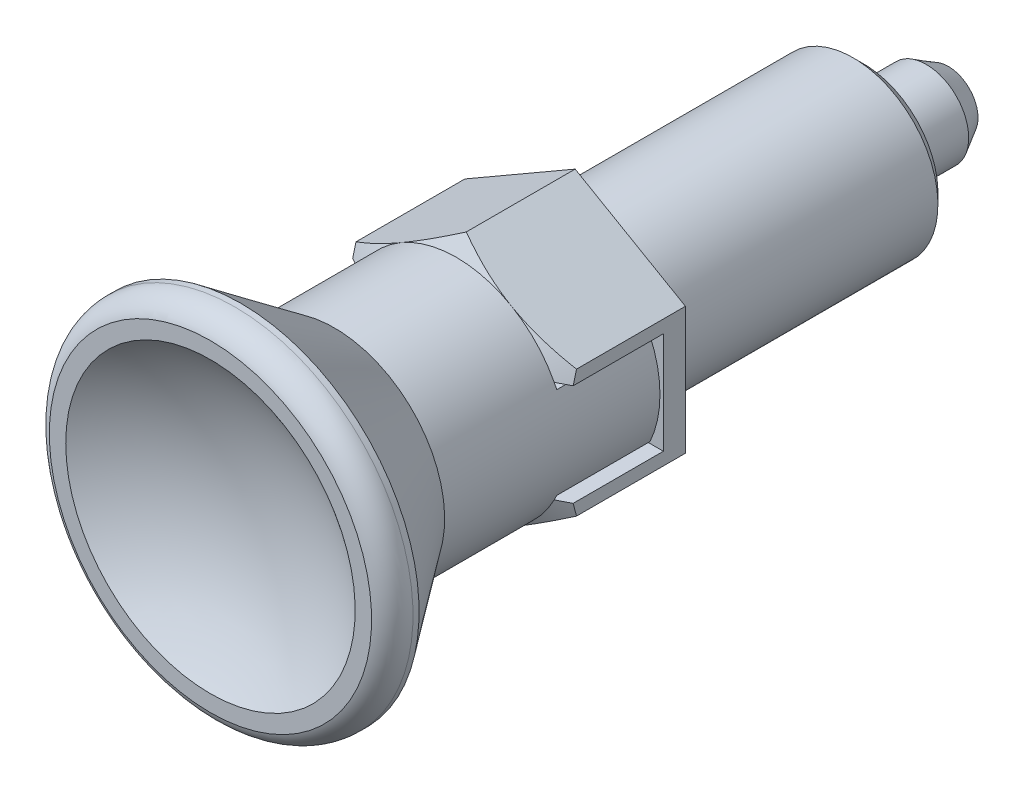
ISO-10303-21;
HEADER;
FILE_DESCRIPTION(('STEP AP214'),'2;1');
FILE_NAME('part.step','',(''),(''),'','','');
FILE_SCHEMA(('AUTOMOTIVE_DESIGN { 1 0 10303 214 1 1 1 1 }'));
ENDSEC;
DATA;
#1=APPLICATION_CONTEXT('core data for automotive mechanical design processes');
#2=APPLICATION_PROTOCOL_DEFINITION('international standard','automotive_design',2000,#1);
#3=PRODUCT_CONTEXT('',#1,'mechanical');
#4=PRODUCT('Part','Part','',(#3));
#5=PRODUCT_RELATED_PRODUCT_CATEGORY('part','',(#4));
#6=PRODUCT_DEFINITION_FORMATION('','',#4);
#7=PRODUCT_DEFINITION_CONTEXT('part definition',#1,'design');
#8=PRODUCT_DEFINITION('design','',#6,#7);
#9=PRODUCT_DEFINITION_SHAPE('','',#8);
#10=(LENGTH_UNIT() NAMED_UNIT(*) SI_UNIT(.MILLI.,.METRE.));
#11=(NAMED_UNIT(*) PLANE_ANGLE_UNIT() SI_UNIT($,.RADIAN.));
#12=(NAMED_UNIT(*) SI_UNIT($,.STERADIAN.) SOLID_ANGLE_UNIT());
#13=UNCERTAINTY_MEASURE_WITH_UNIT(LENGTH_MEASURE(1.E-05),#10,'distance_accuracy_value','');
#14=(GEOMETRIC_REPRESENTATION_CONTEXT(3) GLOBAL_UNCERTAINTY_ASSIGNED_CONTEXT((#13)) GLOBAL_UNIT_ASSIGNED_CONTEXT((#10,
#11,#12)) REPRESENTATION_CONTEXT('',''));
#15=CARTESIAN_POINT('',(0.,0.,0.));
#16=DIRECTION('',(0.,0.,1.));
#17=DIRECTION('',(1.,0.,0.));
#18=AXIS2_PLACEMENT_3D('',#15,#16,#17);
#19=CARTESIAN_POINT('',(6.5,-3.7527767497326,0.));
#20=DIRECTION('',(1.,0.,0.));
#21=DIRECTION('',(0.,1.,0.));
#22=AXIS2_PLACEMENT_3D('',#19,#20,#21);
#23=PLANE('',#22);
#24=DIRECTION('',(0.,-1.,0.));
#25=VECTOR('',#24,1.);
#26=CARTESIAN_POINT('',(6.5,0.,1.3));
#27=LINE('',#26,#25);
#28=CARTESIAN_POINT('',(6.5,3.,1.3));
#29=VERTEX_POINT('',#28);
#30=CARTESIAN_POINT('',(6.5,-3.,1.3));
#31=VERTEX_POINT('',#30);
#32=EDGE_CURVE('E504',#29,#31,#27,.T.);
#33=ORIENTED_EDGE('',*,*,#32,.T.);
#34=DIRECTION('',(0.,0.,1.));
#35=VECTOR('',#34,1.);
#36=CARTESIAN_POINT('',(6.5,-3.,0.));
#37=LINE('',#36,#35);
#38=CARTESIAN_POINT('',(6.49999999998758,-3.,6.61957782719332));
#39=VERTEX_POINT('',#38);
#40=EDGE_CURVE('E326',#31,#39,#37,.T.);
#41=ORIENTED_EDGE('',*,*,#40,.T.);
#42=CARTESIAN_POINT('',(6.5,0.963483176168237,6.95899676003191));
#43=CARTESIAN_POINT('',(6.5,0.814223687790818,6.97165271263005));
#44=CARTESIAN_POINT('',(6.5,0.664715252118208,6.98141670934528));
#45=CARTESIAN_POINT('',(6.5,0.365432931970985,6.99505527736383));
#46=CARTESIAN_POINT('',(6.5,0.215659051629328,6.99892993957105));
#47=CARTESIAN_POINT('',(6.5,-0.0837605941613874,7.00068375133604));
#48=CARTESIAN_POINT('',(6.5,-0.233406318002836,6.99856952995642));
#49=CARTESIAN_POINT('',(6.5,-0.532486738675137,6.98841601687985));
#50=CARTESIAN_POINT('',(6.5,-0.681921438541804,6.98037681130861));
#51=CARTESIAN_POINT('',(6.5,-1.12703862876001,6.94776783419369));
#52=CARTESIAN_POINT('',(6.5,-1.42213092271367,6.91471693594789));
#53=CARTESIAN_POINT('',(6.5,-2.00923282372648,6.82822838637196));
#54=CARTESIAN_POINT('',(6.5,-2.30124241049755,6.77479060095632));
#55=CARTESIAN_POINT('',(6.5,-2.73675218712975,6.68167709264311));
#56=CARTESIAN_POINT('',(6.5,-2.88167228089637,6.64843340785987));
#57=CARTESIAN_POINT('',(6.5,-3.34846544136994,6.53468923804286));
#58=CARTESIAN_POINT('',(6.5,-3.668464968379,6.44641035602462));
#59=CARTESIAN_POINT('',(6.5,-4.30400856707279,6.25459253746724));
#60=CARTESIAN_POINT('',(6.5,-4.61954919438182,6.15104244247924));
#61=CARTESIAN_POINT('',(6.5,-5.24590684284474,5.93242313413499));
#62=CARTESIAN_POINT('',(6.5,-5.55673179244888,5.81737649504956));
#63=CARTESIAN_POINT('',(6.5,-6.02009755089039,5.63814084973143));
#64=CARTESIAN_POINT('',(6.5,-6.17396259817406,5.57733163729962));
#65=CARTESIAN_POINT('',(6.5,-6.4808794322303,5.45372860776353));
#66=CARTESIAN_POINT('',(6.5,-6.6339312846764,5.39093495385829));
#67=CARTESIAN_POINT('',(6.5,-6.786622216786,5.32727397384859));
#68=B_SPLINE_CURVE_WITH_KNOTS('',3,(#42,#43,#44,#45,#46,#47,#48,#49,#50,#51,#52,#53,#54,#55,#56,
#57,#58,#59,#60,#61,#62,#63,#64,#65,#66,#67),.UNSPECIFIED.,.F.,.F.,(4,2,2,2,2,2,2,2,2,2,2,2,4),
(0.,0.44936252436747,0.89871811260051,1.34757650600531,1.79642837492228,2.68636367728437,
3.57630483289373,4.02231730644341,5.01761008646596,6.0136337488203,7.00773870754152,
7.50406500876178,8.00035059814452),.UNSPECIFIED.);
#69=CARTESIAN_POINT('',(6.5,-3.7527767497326,6.41944341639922));
#70=VERTEX_POINT('',#69);
#71=EDGE_CURVE('E509',#39,#70,#68,.T.);
#72=ORIENTED_EDGE('',*,*,#71,.T.);
#73=DIRECTION('',(0.,0.,1.));
#74=VECTOR('',#73,1.);
#75=CARTESIAN_POINT('',(6.5,-3.7527767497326,0.));
#76=LINE('',#75,#74);
#77=CARTESIAN_POINT('',(6.5,-3.7527767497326,0.));
#78=VERTEX_POINT('',#77);
#79=EDGE_CURVE('E43',#78,#70,#76,.T.);
#80=ORIENTED_EDGE('',*,*,#79,.F.);
#81=DIRECTION('',(0.,1.,0.));
#82=VECTOR('',#81,1.);
#83=CARTESIAN_POINT('',(6.5,-3.7527767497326,0.));
#84=LINE('',#83,#82);
#85=CARTESIAN_POINT('',(6.5,3.7527767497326,0.));
#86=VERTEX_POINT('',#85);
#87=EDGE_CURVE('E331',#78,#86,#84,.T.);
#88=ORIENTED_EDGE('',*,*,#87,.T.);
#89=DIRECTION('',(0.,0.,1.));
#90=VECTOR('',#89,1.);
#91=CARTESIAN_POINT('',(6.5,3.7527767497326,0.));
#92=LINE('',#91,#90);
#93=CARTESIAN_POINT('',(6.5,3.7527767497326,6.41944341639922));
#94=VERTEX_POINT('',#93);
#95=EDGE_CURVE('E341',#86,#94,#92,.T.);
#96=ORIENTED_EDGE('',*,*,#95,.T.);
#97=CARTESIAN_POINT('',(6.5,7.25792970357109,5.12760879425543));
#98=CARTESIAN_POINT('',(6.5,7.10495580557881,5.19339665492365));
#99=CARTESIAN_POINT('',(6.5,6.95164943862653,5.25841075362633));
#100=CARTESIAN_POINT('',(6.5,6.64428868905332,5.38667109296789));
#101=CARTESIAN_POINT('',(6.5,6.49023426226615,5.44991722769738));
#102=CARTESIAN_POINT('',(6.5,6.02666413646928,5.63673707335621));
#103=CARTESIAN_POINT('',(6.5,5.71592722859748,5.75731176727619));
#104=CARTESIAN_POINT('',(6.5,5.09449972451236,5.98666191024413));
#105=CARTESIAN_POINT('',(6.5,4.78385682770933,6.09556569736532));
#106=CARTESIAN_POINT('',(6.5,4.15822477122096,6.30027095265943));
#107=CARTESIAN_POINT('',(6.5,3.84323553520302,6.3960721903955));
#108=CARTESIAN_POINT('',(6.5,3.20538987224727,6.57166127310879));
#109=CARTESIAN_POINT('',(6.5,2.88248636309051,6.65128043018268));
#110=CARTESIAN_POINT('',(6.5,2.23214389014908,6.78871993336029));
#111=CARTESIAN_POINT('',(6.5,1.90470796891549,6.84655423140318));
#112=CARTESIAN_POINT('',(6.5,1.40893546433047,6.91399186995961));
#113=CARTESIAN_POINT('',(6.5,1.24189311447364,6.93330856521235));
#114=CARTESIAN_POINT('',(6.5,0.907132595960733,6.96482944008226));
#115=CARTESIAN_POINT('',(6.5,0.739414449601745,6.97703385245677));
#116=CARTESIAN_POINT('',(6.5,0.403170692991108,6.99403225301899));
#117=CARTESIAN_POINT('',(6.5,0.234644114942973,6.99880716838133));
#118=CARTESIAN_POINT('',(6.5,-0.102485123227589,7.00080499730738));
#119=CARTESIAN_POINT('',(6.5,-0.27108779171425,6.9980264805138));
#120=CARTESIAN_POINT('',(6.5,-0.439545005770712,6.99142948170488));
#121=B_SPLINE_CURVE_WITH_KNOTS('',3,(#97,#98,#99,#100,#101,#102,#103,#104,#105,#106,#107,#108,
#109,#110,#111,#112,#113,#114,#115,#116,#117,#118,#119,#120),.UNSPECIFIED.,.F.,.F.,(4,2,2,2,2,2,
2,2,2,2,2,4),(0.,0.499557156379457,0.999144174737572,1.99892502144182,2.9862441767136,
3.97358069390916,4.97073405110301,5.96724769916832,6.4715857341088,6.97590726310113,
7.48152135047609,7.98723119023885),.UNSPECIFIED.);
#122=CARTESIAN_POINT('',(6.50000000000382,3.,6.61957782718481));
#123=VERTEX_POINT('',#122);
#124=EDGE_CURVE('E600',#94,#123,#121,.T.);
#125=ORIENTED_EDGE('',*,*,#124,.T.);
#126=DIRECTION('',(0.,0.,-1.));
#127=VECTOR('',#126,1.);
#128=CARTESIAN_POINT('',(6.5,3.,0.));
#129=LINE('',#128,#127);
#130=EDGE_CURVE('E299',#123,#29,#129,.T.);
#131=ORIENTED_EDGE('',*,*,#130,.T.);
#132=EDGE_LOOP('',(#33,#41,#72,#80,#88,#96,#125,#131));
#133=FACE_BOUND('',#132,.T.);
#134=ADVANCED_FACE('F14',(#133),#23,.T.);
#135=CARTESIAN_POINT('',(0.,0.,5.2679491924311));
#136=DIRECTION('',(0.,0.,-1.));
#137=DIRECTION('',(0.,1.,0.));
#138=AXIS2_PLACEMENT_3D('',#135,#136,#137);
#139=CONICAL_SURFACE('',#138,9.5,1.04719755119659);
#140=CARTESIAN_POINT('',(11.1002089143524,3.,4.11413637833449));
#141=CARTESIAN_POINT('',(10.8765517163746,3.,4.23878933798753));
#142=CARTESIAN_POINT('',(10.6527882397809,3.,4.36325181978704));
#143=CARTESIAN_POINT('',(10.205000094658,3.,4.61170799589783));
#144=CARTESIAN_POINT('',(9.98097542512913,3.,4.7357016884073));
#145=CARTESIAN_POINT('',(9.30849962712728,3.,5.10681308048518));
#146=CARTESIAN_POINT('',(8.85958649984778,3.,5.35309471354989));
#147=CARTESIAN_POINT('',(7.96090866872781,3.,5.8417999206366));
#148=CARTESIAN_POINT('',(7.51114787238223,3.,6.0842306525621));
#149=CARTESIAN_POINT('',(6.83431191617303,3.,6.44386576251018));
#150=CARTESIAN_POINT('',(6.60831040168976,3.,6.56308788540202));
#151=CARTESIAN_POINT('',(6.15537448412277,3.,6.79974592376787));
#152=CARTESIAN_POINT('',(5.92844008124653,3.,6.9171818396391));
#153=CARTESIAN_POINT('',(5.38941916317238,3.,7.19260093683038));
#154=CARTESIAN_POINT('',(5.07680456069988,3.,7.34955954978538));
#155=CARTESIAN_POINT('',(4.60544358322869,3.,7.57980729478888));
#156=CARTESIAN_POINT('',(4.44795699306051,3.,7.65567293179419));
#157=CARTESIAN_POINT('',(4.1319260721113,3.,7.80520264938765));
#158=CARTESIAN_POINT('',(3.97338167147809,3.,7.8788665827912));
#159=CARTESIAN_POINT('',(3.65468713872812,3.,8.02349039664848));
#160=CARTESIAN_POINT('',(3.49453448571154,3.,8.09444474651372));
#161=CARTESIAN_POINT('',(3.17264231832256,3.,8.23258751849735));
#162=CARTESIAN_POINT('',(3.01090311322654,3.,8.29977665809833));
#163=CARTESIAN_POINT('',(2.68515409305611,3.,8.42926948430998));
#164=CARTESIAN_POINT('',(2.5211410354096,3.,8.49156511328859));
#165=CARTESIAN_POINT('',(2.27325675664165,3.,8.57995327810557));
#166=CARTESIAN_POINT('',(2.19029022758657,3.,8.60858205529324));
#167=CARTESIAN_POINT('',(2.02368807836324,3.,8.66386332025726));
#168=CARTESIAN_POINT('',(1.9400523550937,3.,8.69051549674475));
#169=CARTESIAN_POINT('',(1.85606261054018,3.,8.71603356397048));
#170=B_SPLINE_CURVE_WITH_KNOTS('',3,(#140,#141,#142,#143,#144,#145,#146,#147,#148,#149,#150,
#151,#152,#153,#154,#155,#156,#157,#158,#159,#160,#161,#162,#163,#164,#165,#166,#167,#168,#169),
.UNSPECIFIED.,.F.,.F.,(4,2,2,2,2,2,2,2,2,2,2,2,2,2,4),(0.,0.768145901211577,1.53629475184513,
3.07238557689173,4.60517297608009,5.37172692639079,6.13828070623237,7.18763161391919,
7.71204115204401,8.23648566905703,8.76194892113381,9.28731170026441,9.81352215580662,
10.0768009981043,10.3401212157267),.UNSPECIFIED.);
#171=CARTESIAN_POINT('',(5.7662812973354,3.,7.));
#172=VERTEX_POINT('',#171);
#173=EDGE_CURVE('E292',#123,#172,#170,.T.);
#174=ORIENTED_EDGE('',*,*,#173,.F.);
#175=ORIENTED_EDGE('',*,*,#124,.F.);
#176=CARTESIAN_POINT('',(-0.000200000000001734,7.50566896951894,6.41937674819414));
#177=CARTESIAN_POINT('',(0.142677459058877,7.42317863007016,6.46699557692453));
#178=CARTESIAN_POINT('',(0.286087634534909,7.34038072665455,6.51245329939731));
#179=CARTESIAN_POINT('',(0.574072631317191,7.17411251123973,6.59845131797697));
#180=CARTESIAN_POINT('',(0.718647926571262,7.09064192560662,6.63898949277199));
#181=CARTESIAN_POINT('',(1.15468865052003,6.83889369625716,6.75242899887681));
#182=CARTESIAN_POINT('',(1.44787528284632,6.66962231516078,6.81695219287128));
#183=CARTESIAN_POINT('',(1.88662374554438,6.41631077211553,6.89261341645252));
#184=CARTESIAN_POINT('',(2.03087463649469,6.33302748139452,6.91416714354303));
#185=CARTESIAN_POINT('',(2.32002821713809,6.16608458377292,6.95030968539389));
#186=CARTESIAN_POINT('',(2.46493084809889,6.08242501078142,6.96489911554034));
#187=CARTESIAN_POINT('',(2.75498777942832,5.91496056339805,6.98674124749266));
#188=CARTESIAN_POINT('',(2.90014160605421,5.83115596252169,6.9940022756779));
#189=CARTESIAN_POINT('',(3.19057533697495,5.66347396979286,7.00103969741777));
#190=CARTESIAN_POINT('',(3.33585523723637,5.5795965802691,7.00081632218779));
#191=CARTESIAN_POINT('',(3.7338759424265,5.34979921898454,6.98991654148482));
#192=CARTESIAN_POINT('',(3.98648646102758,5.20395446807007,6.97161818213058));
#193=CARTESIAN_POINT('',(4.49002967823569,4.91323365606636,6.91359365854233));
#194=CARTESIAN_POINT('',(4.74096060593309,4.76835861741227,6.87384766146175));
#195=CARTESIAN_POINT('',(5.24551722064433,4.47705272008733,6.77449409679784));
#196=CARTESIAN_POINT('',(5.49907924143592,4.33065861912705,6.71446557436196));
#197=CARTESIAN_POINT('',(6.00242193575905,4.04005357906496,6.57822500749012));
#198=CARTESIAN_POINT('',(6.25220905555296,3.89583891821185,6.50204496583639));
#199=CARTESIAN_POINT('',(6.5002,3.75266127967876,6.41937674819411));
#200=B_SPLINE_CURVE_WITH_KNOTS('',3,(#176,#177,#178,#179,#180,#181,#182,#183,#184,#185,#186,
#187,#188,#189,#190,#191,#192,#193,#194,#195,#196,#197,#198,#199),.UNSPECIFIED.,.F.,.F.,(4,2,2,
2,2,2,2,2,2,2,2,4),(0.,0.515105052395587,1.03043143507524,2.06322554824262,2.56697389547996,
3.07067772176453,3.57380860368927,4.0769239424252,4.95279354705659,5.82947446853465,
6.72559912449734,7.61996451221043),.UNSPECIFIED.);
#201=CARTESIAN_POINT('',(3.24999999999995,5.62916512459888,7.));
#202=VERTEX_POINT('',#201);
#203=EDGE_CURVE('E456',#202,#94,#200,.T.);
#204=ORIENTED_EDGE('',*,*,#203,.F.);
#205=CARTESIAN_POINT('',(0.,0.,7.));
#206=DIRECTION('',(0.,0.,1.));
#207=DIRECTION('',(0.,-1.,0.));
#208=AXIS2_PLACEMENT_3D('',#205,#206,#207);
#209=CIRCLE('',#208,6.5);
#210=EDGE_CURVE('E421',#172,#202,#209,.T.);
#211=ORIENTED_EDGE('',*,*,#210,.F.);
#212=EDGE_LOOP('',(#174,#175,#204,#211));
#213=FACE_BOUND('',#212,.T.);
#214=ADVANCED_FACE('F497',(#213),#139,.T.);
#215=CARTESIAN_POINT('',(2.01126617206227,-3.,8.66749566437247));
#216=CARTESIAN_POINT('',(2.08933753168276,-3.,8.64239159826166));
#217=CARTESIAN_POINT('',(2.16711174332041,-3.,8.61638316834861));
#218=CARTESIAN_POINT('',(2.32210155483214,-3.,8.56277706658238));
#219=CARTESIAN_POINT('',(2.39931721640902,-3.,8.53517957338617));
#220=CARTESIAN_POINT('',(2.63013065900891,-3.,8.45035157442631));
#221=CARTESIAN_POINT('',(2.7829712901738,-3.,8.39106053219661));
#222=CARTESIAN_POINT('',(3.08676234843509,-3.,8.26840268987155));
#223=CARTESIAN_POINT('',(3.23771495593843,-3.,8.20504123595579));
#224=CARTESIAN_POINT('',(3.53826205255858,-3.,8.0751298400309));
#225=CARTESIAN_POINT('',(3.68785634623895,-3.,8.00857944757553));
#226=CARTESIAN_POINT('',(3.98567075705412,-3.,7.8731254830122));
#227=CARTESIAN_POINT('',(4.1338927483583,-3.,7.80422601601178));
#228=CARTESIAN_POINT('',(4.42942067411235,-3.,7.66448678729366));
#229=CARTESIAN_POINT('',(4.57672658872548,-3.,7.59364698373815));
#230=CARTESIAN_POINT('',(5.01763300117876,-3.,7.37877677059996));
#231=CARTESIAN_POINT('',(5.31011183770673,-3.,7.23244650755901));
#232=CARTESIAN_POINT('',(5.83441159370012,-3.,6.96558661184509));
#233=CARTESIAN_POINT('',(6.06660565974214,-3.,6.84578448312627));
#234=CARTESIAN_POINT('',(6.52998834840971,-3.,6.60424957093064));
#235=CARTESIAN_POINT('',(6.76117696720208,-3.,6.48251678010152));
#236=CARTESIAN_POINT('',(7.45351984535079,-3.,6.11519261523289));
#237=CARTESIAN_POINT('',(7.91352456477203,-3.,5.86743765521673));
#238=CARTESIAN_POINT('',(8.83257296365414,-3.,5.36790352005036));
#239=CARTESIAN_POINT('',(9.29161266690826,-3.,5.11611705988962));
#240=CARTESIAN_POINT('',(9.97922015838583,-3.,4.73667773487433));
#241=CARTESIAN_POINT('',(10.2082716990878,-3.,4.6099003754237));
#242=CARTESIAN_POINT('',(10.6661021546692,-3.,4.3558566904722));
#243=CARTESIAN_POINT('',(10.8948810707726,-3.,4.2285903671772));
#244=CARTESIAN_POINT('',(11.1235496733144,-3.,4.10112639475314));
#245=B_SPLINE_CURVE_WITH_KNOTS('',3,(#215,#216,#217,#218,#219,#220,#221,#222,#223,#224,#225,
#226,#227,#228,#229,#230,#231,#232,#233,#234,#235,#236,#237,#238,#239,#240,#241,#242,#243,#244),
.UNSPECIFIED.,.F.,.F.,(4,2,2,2,2,2,2,2,2,2,2,2,2,2,4),(0.,0.246009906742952,0.491992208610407,
0.983715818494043,1.47480629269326,1.96596634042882,2.4563081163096,2.94666047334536,
3.92772968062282,4.71155818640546,5.49538967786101,7.06280490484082,8.63347330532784,
9.41886056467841,10.2042442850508),.UNSPECIFIED.);
#246=CARTESIAN_POINT('',(5.7662812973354,-3.,7.));
#247=VERTEX_POINT('',#246);
#248=EDGE_CURVE('E320',#247,#39,#245,.T.);
#249=ORIENTED_EDGE('',*,*,#248,.F.);
#250=CARTESIAN_POINT('',(3.24999999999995,-5.62916512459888,7.));
#251=VERTEX_POINT('',#250);
#252=EDGE_CURVE('E552',#251,#247,#209,.T.);
#253=ORIENTED_EDGE('',*,*,#252,.F.);
#254=CARTESIAN_POINT('',(6.5002,-3.75266127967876,6.41937674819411));
#255=CARTESIAN_POINT('',(6.35732254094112,-3.83515161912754,6.4669955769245));
#256=CARTESIAN_POINT('',(6.21391236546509,-3.91794952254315,6.51245329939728));
#257=CARTESIAN_POINT('',(5.9259273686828,-4.08421773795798,6.59845131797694));
#258=CARTESIAN_POINT('',(5.78135207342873,-4.16768832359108,6.63898949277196));
#259=CARTESIAN_POINT('',(5.34531134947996,-4.41943655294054,6.75242899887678));
#260=CARTESIAN_POINT('',(5.05212471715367,-4.58870793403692,6.81695219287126));
#261=CARTESIAN_POINT('',(4.61337625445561,-4.84201947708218,6.89261341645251));
#262=CARTESIAN_POINT('',(4.46912536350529,-4.92530276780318,6.91416714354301));
#263=CARTESIAN_POINT('',(4.17997178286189,-5.09224566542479,6.95030968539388));
#264=CARTESIAN_POINT('',(4.03506915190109,-5.17590523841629,6.96489911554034));
#265=CARTESIAN_POINT('',(3.74501222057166,-5.34336968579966,6.98674124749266));
#266=CARTESIAN_POINT('',(3.59985839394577,-5.42717428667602,6.9940022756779));
#267=CARTESIAN_POINT('',(3.30942466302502,-5.59485627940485,7.00103969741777));
#268=CARTESIAN_POINT('',(3.16414476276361,-5.67873366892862,7.0008163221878));
#269=CARTESIAN_POINT('',(2.76612405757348,-5.90853103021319,6.98991654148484));
#270=CARTESIAN_POINT('',(2.5135135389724,-6.05437578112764,6.97161818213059));
#271=CARTESIAN_POINT('',(2.0099703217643,-6.34509659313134,6.91359365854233));
#272=CARTESIAN_POINT('',(1.7590393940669,-6.48997163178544,6.87384766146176));
#273=CARTESIAN_POINT('',(1.25448277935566,-6.78127752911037,6.77449409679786));
#274=CARTESIAN_POINT('',(1.00092075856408,-6.92767163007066,6.71446557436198));
#275=CARTESIAN_POINT('',(0.497578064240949,-7.21827667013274,6.57822500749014));
#276=CARTESIAN_POINT('',(0.247790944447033,-7.36249133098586,6.50204496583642));
#277=CARTESIAN_POINT('',(-0.000199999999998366,-7.50566896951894,6.41937674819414));
#278=B_SPLINE_CURVE_WITH_KNOTS('',3,(#254,#255,#256,#257,#258,#259,#260,#261,#262,#263,#264,
#265,#266,#267,#268,#269,#270,#271,#272,#273,#274,#275,#276,#277),.UNSPECIFIED.,.F.,.F.,(4,2,2,
2,2,2,2,2,2,2,2,4),(0.,0.515105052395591,1.03043143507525,2.06322554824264,2.56697389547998,
3.07067772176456,3.5738086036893,4.07692394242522,4.95279354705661,5.82947446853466,
6.72559912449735,7.61996451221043),.UNSPECIFIED.);
#279=EDGE_CURVE('E398',#70,#251,#278,.T.);
#280=ORIENTED_EDGE('',*,*,#279,.F.);
#281=ORIENTED_EDGE('',*,*,#71,.F.);
#282=EDGE_LOOP('',(#249,#253,#280,#281));
#283=FACE_BOUND('',#282,.T.);
#284=ADVANCED_FACE('F492',(#283),#139,.T.);
#285=CARTESIAN_POINT('',(0.,0.,-22.));
#286=DIRECTION('',(0.,0.,1.));
#287=DIRECTION('',(0.,-1.,0.));
#288=AXIS2_PLACEMENT_3D('',#285,#286,#287);
#289=CYLINDRICAL_SURFACE('',#288,6.5);
#290=CARTESIAN_POINT('',(0.,0.,1.5));
#291=DIRECTION('',(0.,0.,1.));
#292=DIRECTION('',(0.,-1.,0.));
#293=AXIS2_PLACEMENT_3D('',#290,#291,#292);
#294=CIRCLE('',#293,6.5);
#295=CARTESIAN_POINT('',(-5.9126981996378,-2.7,1.5));
#296=VERTEX_POINT('',#295);
#297=CARTESIAN_POINT('',(-5.9126981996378,2.7,1.5));
#298=VERTEX_POINT('',#297);
#299=EDGE_CURVE('E242',#296,#298,#294,.F.);
#300=ORIENTED_EDGE('',*,*,#299,.F.);
#301=DIRECTION('',(0.,0.,1.));
#302=VECTOR('',#301,1.);
#303=CARTESIAN_POINT('',(-5.9126981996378,-2.7,1.3));
#304=LINE('',#303,#302);
#305=CARTESIAN_POINT('',(-5.91269819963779,-2.7,7.));
#306=VERTEX_POINT('',#305);
#307=EDGE_CURVE('E408',#296,#306,#304,.T.);
#308=ORIENTED_EDGE('',*,*,#307,.T.);
#309=CARTESIAN_POINT('',(-5.7662812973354,-3.,7.));
#310=VERTEX_POINT('',#309);
#311=EDGE_CURVE('E423',#306,#310,#209,.T.);
#312=ORIENTED_EDGE('',*,*,#311,.T.);
#313=CARTESIAN_POINT('',(-3.24999999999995,-5.62916512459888,7.));
#314=VERTEX_POINT('',#313);
#315=EDGE_CURVE('E422',#310,#314,#209,.T.);
#316=ORIENTED_EDGE('',*,*,#315,.T.);
#317=EDGE_CURVE('E553',#314,#251,#209,.T.);
#318=ORIENTED_EDGE('',*,*,#317,.T.);
#319=ORIENTED_EDGE('',*,*,#252,.T.);
#320=CARTESIAN_POINT('',(5.91269819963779,-2.7,7.));
#321=VERTEX_POINT('',#320);
#322=EDGE_CURVE('E416',#247,#321,#209,.T.);
#323=ORIENTED_EDGE('',*,*,#322,.T.);
#324=DIRECTION('',(0.,0.,1.));
#325=VECTOR('',#324,1.);
#326=CARTESIAN_POINT('',(5.9126981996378,-2.7,1.3));
#327=LINE('',#326,#325);
#328=CARTESIAN_POINT('',(5.9126981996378,-2.7,1.5));
#329=VERTEX_POINT('',#328);
#330=EDGE_CURVE('E411',#329,#321,#327,.T.);
#331=ORIENTED_EDGE('',*,*,#330,.F.);
#332=CARTESIAN_POINT('',(0.,0.,1.5));
#333=DIRECTION('',(0.,0.,-1.));
#334=DIRECTION('',(0.,1.,0.));
#335=AXIS2_PLACEMENT_3D('',#332,#333,#334);
#336=CIRCLE('',#335,6.5);
#337=CARTESIAN_POINT('',(5.91269819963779,2.7,1.5));
#338=VERTEX_POINT('',#337);
#339=EDGE_CURVE('E536',#329,#338,#336,.F.);
#340=ORIENTED_EDGE('',*,*,#339,.T.);
#341=DIRECTION('',(0.,0.,1.));
#342=VECTOR('',#341,1.);
#343=CARTESIAN_POINT('',(5.9126981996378,2.7,1.3));
#344=LINE('',#343,#342);
#345=CARTESIAN_POINT('',(5.91269819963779,2.7,7.));
#346=VERTEX_POINT('',#345);
#347=EDGE_CURVE('E413',#338,#346,#344,.T.);
#348=ORIENTED_EDGE('',*,*,#347,.T.);
#349=EDGE_CURVE('E417',#346,#172,#209,.T.);
#350=ORIENTED_EDGE('',*,*,#349,.T.);
#351=ORIENTED_EDGE('',*,*,#210,.T.);
#352=CARTESIAN_POINT('',(-3.24999999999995,5.62916512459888,7.));
#353=VERTEX_POINT('',#352);
#354=EDGE_CURVE('E529',#202,#353,#209,.T.);
#355=ORIENTED_EDGE('',*,*,#354,.T.);
#356=CARTESIAN_POINT('',(-5.7662812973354,3.,7.));
#357=VERTEX_POINT('',#356);
#358=EDGE_CURVE('E554',#353,#357,#209,.T.);
#359=ORIENTED_EDGE('',*,*,#358,.T.);
#360=CARTESIAN_POINT('',(-5.9126981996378,2.7,7.));
#361=VERTEX_POINT('',#360);
#362=EDGE_CURVE('E530',#357,#361,#209,.T.);
#363=ORIENTED_EDGE('',*,*,#362,.T.);
#364=DIRECTION('',(0.,0.,1.));
#365=VECTOR('',#364,1.);
#366=CARTESIAN_POINT('',(-5.9126981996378,2.7,1.3));
#367=LINE('',#366,#365);
#368=EDGE_CURVE('E405',#298,#361,#367,.T.);
#369=ORIENTED_EDGE('',*,*,#368,.F.);
#370=EDGE_LOOP('',(#300,#308,#312,#316,#318,#319,#323,#331,#340,#348,#350,#351,#355,#359,#363,#369));
#371=FACE_BOUND('',#370,.T.);
#372=CARTESIAN_POINT('',(0.,0.,14.1944723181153));
#373=DIRECTION('',(0.,0.,1.));
#374=DIRECTION('',(0.,-1.,0.));
#375=AXIS2_PLACEMENT_3D('',#372,#373,#374);
#376=CIRCLE('',#375,6.5);
#377=CARTESIAN_POINT('',(0.,-6.5,14.1944723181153));
#378=VERTEX_POINT('',#377);
#379=EDGE_CURVE('E441',#378,#378,#376,.T.);
#380=ORIENTED_EDGE('',*,*,#379,.F.);
#381=EDGE_LOOP('',(#380));
#382=FACE_BOUND('',#381,.T.);
#383=ADVANCED_FACE('F532',(#371,#382),#289,.T.);
#384=CARTESIAN_POINT('',(5.,0.,0.));
#385=DIRECTION('',(0.,0.,1.));
#386=DIRECTION('',(0.,-1.,0.));
#387=AXIS2_PLACEMENT_3D('',#384,#385,#386);
#388=PLANE('',#387);
#389=CARTESIAN_POINT('',(0.,0.,0.));
#390=DIRECTION('',(0.,0.,1.));
#391=DIRECTION('',(0.,-1.,0.));
#392=AXIS2_PLACEMENT_3D('',#389,#390,#391);
#393=CIRCLE('',#392,5.);
#394=CARTESIAN_POINT('',(0.,-5.,0.));
#395=VERTEX_POINT('',#394);
#396=EDGE_CURVE('E420',#395,#395,#393,.T.);
#397=ORIENTED_EDGE('',*,*,#396,.T.);
#398=EDGE_LOOP('',(#397));
#399=FACE_BOUND('',#398,.T.);
#400=DIRECTION('',(-0.866025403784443,0.499999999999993,0.));
#401=VECTOR('',#400,1.);
#402=CARTESIAN_POINT('',(6.5,3.7527767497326,0.));
#403=LINE('',#402,#401);
#404=CARTESIAN_POINT('',(0.,7.5055534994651,0.));
#405=VERTEX_POINT('',#404);
#406=EDGE_CURVE('E329',#86,#405,#403,.T.);
#407=ORIENTED_EDGE('',*,*,#406,.F.);
#408=ORIENTED_EDGE('',*,*,#87,.F.);
#409=DIRECTION('',(0.866025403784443,0.499999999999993,0.));
#410=VECTOR('',#409,1.);
#411=CARTESIAN_POINT('',(0.,-7.5055534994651,0.));
#412=LINE('',#411,#410);
#413=CARTESIAN_POINT('',(0.,-7.5055534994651,0.));
#414=VERTEX_POINT('',#413);
#415=EDGE_CURVE('E333',#414,#78,#412,.T.);
#416=ORIENTED_EDGE('',*,*,#415,.F.);
#417=DIRECTION('',(0.866025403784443,-0.499999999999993,0.));
#418=VECTOR('',#417,1.);
#419=CARTESIAN_POINT('',(-6.5,-3.7527767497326,0.));
#420=LINE('',#419,#418);
#421=CARTESIAN_POINT('',(-6.5,-3.7527767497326,0.));
#422=VERTEX_POINT('',#421);
#423=EDGE_CURVE('E335',#422,#414,#420,.T.);
#424=ORIENTED_EDGE('',*,*,#423,.F.);
#425=DIRECTION('',(0.,-1.,0.));
#426=VECTOR('',#425,1.);
#427=CARTESIAN_POINT('',(-6.5,3.7527767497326,0.));
#428=LINE('',#427,#426);
#429=CARTESIAN_POINT('',(-6.5,3.7527767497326,0.));
#430=VERTEX_POINT('',#429);
#431=EDGE_CURVE('E337',#430,#422,#428,.T.);
#432=ORIENTED_EDGE('',*,*,#431,.F.);
#433=DIRECTION('',(-0.866025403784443,-0.499999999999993,0.));
#434=VECTOR('',#433,1.);
#435=CARTESIAN_POINT('',(0.,7.5055534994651,0.));
#436=LINE('',#435,#434);
#437=EDGE_CURVE('E339',#405,#430,#436,.T.);
#438=ORIENTED_EDGE('',*,*,#437,.F.);
#439=EDGE_LOOP('',(#407,#408,#416,#424,#432,#438));
#440=FACE_BOUND('',#439,.T.);
#441=ADVANCED_FACE('F385',(#399,#440),#388,.F.);
#442=CARTESIAN_POINT('',(-6.5,-3.7527767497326,0.));
#443=DIRECTION('',(-0.499999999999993,-0.866025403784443,0.));
#444=DIRECTION('',(0.866025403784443,-0.499999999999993,0.));
#445=AXIS2_PLACEMENT_3D('',#442,#443,#444);
#446=PLANE('',#445);
#447=CARTESIAN_POINT('',(0.000200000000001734,-7.50566896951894,6.41937674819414));
#448=CARTESIAN_POINT('',(-0.142677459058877,-7.42317863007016,6.46699557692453));
#449=CARTESIAN_POINT('',(-0.286087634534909,-7.34038072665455,6.51245329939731));
#450=CARTESIAN_POINT('',(-0.574072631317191,-7.17411251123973,6.59845131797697));
#451=CARTESIAN_POINT('',(-0.718647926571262,-7.09064192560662,6.63898949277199));
#452=CARTESIAN_POINT('',(-1.15468865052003,-6.83889369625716,6.75242899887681));
#453=CARTESIAN_POINT('',(-1.44787528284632,-6.66962231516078,6.81695219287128));
#454=CARTESIAN_POINT('',(-1.88662374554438,-6.41631077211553,6.89261341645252));
#455=CARTESIAN_POINT('',(-2.03087463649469,-6.33302748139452,6.91416714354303));
#456=CARTESIAN_POINT('',(-2.32002821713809,-6.16608458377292,6.95030968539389));
#457=CARTESIAN_POINT('',(-2.46493084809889,-6.08242501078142,6.96489911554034));
#458=CARTESIAN_POINT('',(-2.75498777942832,-5.91496056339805,6.98674124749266));
#459=CARTESIAN_POINT('',(-2.90014160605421,-5.83115596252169,6.9940022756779));
#460=CARTESIAN_POINT('',(-3.19057533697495,-5.66347396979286,7.00103969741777));
#461=CARTESIAN_POINT('',(-3.33585523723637,-5.5795965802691,7.00081632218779));
#462=CARTESIAN_POINT('',(-3.7338759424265,-5.34979921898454,6.98991654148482));
#463=CARTESIAN_POINT('',(-3.98648646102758,-5.20395446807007,6.97161818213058));
#464=CARTESIAN_POINT('',(-4.49002967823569,-4.91323365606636,6.91359365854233));
#465=CARTESIAN_POINT('',(-4.74096060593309,-4.76835861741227,6.87384766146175));
#466=CARTESIAN_POINT('',(-5.24551722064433,-4.47705272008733,6.77449409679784));
#467=CARTESIAN_POINT('',(-5.49907924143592,-4.33065861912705,6.71446557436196));
#468=CARTESIAN_POINT('',(-6.00242193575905,-4.04005357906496,6.57822500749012));
#469=CARTESIAN_POINT('',(-6.25220905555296,-3.89583891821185,6.50204496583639));
#470=CARTESIAN_POINT('',(-6.5002,-3.75266127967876,6.41937674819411));
#471=B_SPLINE_CURVE_WITH_KNOTS('',3,(#447,#448,#449,#450,#451,#452,#453,#454,#455,#456,#457,
#458,#459,#460,#461,#462,#463,#464,#465,#466,#467,#468,#469,#470),.UNSPECIFIED.,.F.,.F.,(4,2,2,
2,2,2,2,2,2,2,2,4),(0.,0.515105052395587,1.03043143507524,2.06322554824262,2.56697389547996,
3.07067772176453,3.57380860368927,4.0769239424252,4.95279354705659,5.82947446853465,
6.72559912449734,7.61996451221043),.UNSPECIFIED.);
#472=CARTESIAN_POINT('',(0.,-7.5055534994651,6.41944341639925));
#473=VERTEX_POINT('',#472);
#474=EDGE_CURVE('E397',#473,#314,#471,.T.);
#475=ORIENTED_EDGE('',*,*,#474,.T.);
#476=CARTESIAN_POINT('',(-6.5,-3.7527767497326,6.41944341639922));
#477=VERTEX_POINT('',#476);
#478=EDGE_CURVE('E390',#314,#477,#471,.T.);
#479=ORIENTED_EDGE('',*,*,#478,.T.);
#480=DIRECTION('',(0.,0.,1.));
#481=VECTOR('',#480,1.);
#482=CARTESIAN_POINT('',(-6.5,-3.7527767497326,0.));
#483=LINE('',#482,#481);
#484=EDGE_CURVE('E346',#422,#477,#483,.T.);
#485=ORIENTED_EDGE('',*,*,#484,.F.);
#486=ORIENTED_EDGE('',*,*,#423,.T.);
#487=DIRECTION('',(0.,0.,1.));
#488=VECTOR('',#487,1.);
#489=CARTESIAN_POINT('',(0.,-7.5055534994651,0.));
#490=LINE('',#489,#488);
#491=EDGE_CURVE('E349',#414,#473,#490,.T.);
#492=ORIENTED_EDGE('',*,*,#491,.T.);
#493=EDGE_LOOP('',(#475,#479,#485,#486,#492));
#494=FACE_BOUND('',#493,.T.);
#495=ADVANCED_FACE('F379',(#494),#446,.T.);
#496=CARTESIAN_POINT('',(0.,-7.5055534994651,0.));
#497=DIRECTION('',(0.499999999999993,-0.866025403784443,0.));
#498=DIRECTION('',(0.866025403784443,0.499999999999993,0.));
#499=AXIS2_PLACEMENT_3D('',#496,#497,#498);
#500=PLANE('',#499);
#501=ORIENTED_EDGE('',*,*,#279,.T.);
#502=EDGE_CURVE('E399',#251,#473,#278,.T.);
#503=ORIENTED_EDGE('',*,*,#502,.T.);
#504=ORIENTED_EDGE('',*,*,#491,.F.);
#505=ORIENTED_EDGE('',*,*,#415,.T.);
#506=ORIENTED_EDGE('',*,*,#79,.T.);
#507=EDGE_LOOP('',(#501,#503,#504,#505,#506));
#508=FACE_BOUND('',#507,.T.);
#509=ADVANCED_FACE('F384',(#508),#500,.T.);
#510=CARTESIAN_POINT('',(6.5,3.7527767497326,0.));
#511=DIRECTION('',(0.499999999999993,0.866025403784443,0.));
#512=DIRECTION('',(-0.866025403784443,0.499999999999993,0.));
#513=AXIS2_PLACEMENT_3D('',#510,#511,#512);
#514=PLANE('',#513);
#515=CARTESIAN_POINT('',(0.,7.5055534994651,6.41944341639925));
#516=VERTEX_POINT('',#515);
#517=EDGE_CURVE('E463',#516,#202,#200,.T.);
#518=ORIENTED_EDGE('',*,*,#517,.T.);
#519=ORIENTED_EDGE('',*,*,#203,.T.);
#520=ORIENTED_EDGE('',*,*,#95,.F.);
#521=ORIENTED_EDGE('',*,*,#406,.T.);
#522=DIRECTION('',(0.,0.,1.));
#523=VECTOR('',#522,1.);
#524=CARTESIAN_POINT('',(0.,7.5055534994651,0.));
#525=LINE('',#524,#523);
#526=EDGE_CURVE('E345',#405,#516,#525,.T.);
#527=ORIENTED_EDGE('',*,*,#526,.T.);
#528=EDGE_LOOP('',(#518,#519,#520,#521,#527));
#529=FACE_BOUND('',#528,.T.);
#530=ADVANCED_FACE('F470',(#529),#514,.T.);
#531=CARTESIAN_POINT('',(0.,7.5055534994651,0.));
#532=DIRECTION('',(-0.499999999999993,0.866025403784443,0.));
#533=DIRECTION('',(-0.866025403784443,-0.499999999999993,0.));
#534=AXIS2_PLACEMENT_3D('',#531,#532,#533);
#535=PLANE('',#534);
#536=CARTESIAN_POINT('',(-6.5002,3.75266127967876,6.41937674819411));
#537=CARTESIAN_POINT('',(-6.35732254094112,3.83515161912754,6.4669955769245));
#538=CARTESIAN_POINT('',(-6.21391236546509,3.91794952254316,6.51245329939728));
#539=CARTESIAN_POINT('',(-5.9259273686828,4.08421773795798,6.59845131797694));
#540=CARTESIAN_POINT('',(-5.78135207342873,4.16768832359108,6.63898949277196));
#541=CARTESIAN_POINT('',(-5.34531134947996,4.41943655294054,6.75242899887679));
#542=CARTESIAN_POINT('',(-5.05212471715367,4.58870793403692,6.81695219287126));
#543=CARTESIAN_POINT('',(-4.61337625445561,4.84201947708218,6.89261341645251));
#544=CARTESIAN_POINT('',(-4.46912536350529,4.92530276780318,6.91416714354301));
#545=CARTESIAN_POINT('',(-4.17997178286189,5.09224566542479,6.95030968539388));
#546=CARTESIAN_POINT('',(-4.03506915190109,5.17590523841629,6.96489911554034));
#547=CARTESIAN_POINT('',(-3.74501222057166,5.34336968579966,6.98674124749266));
#548=CARTESIAN_POINT('',(-3.59985839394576,5.42717428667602,6.9940022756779));
#549=CARTESIAN_POINT('',(-3.30942466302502,5.59485627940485,7.00103969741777));
#550=CARTESIAN_POINT('',(-3.16414476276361,5.67873366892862,7.0008163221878));
#551=CARTESIAN_POINT('',(-2.76612405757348,5.90853103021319,6.98991654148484));
#552=CARTESIAN_POINT('',(-2.5135135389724,6.05437578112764,6.97161818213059));
#553=CARTESIAN_POINT('',(-2.0099703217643,6.34509659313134,6.91359365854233));
#554=CARTESIAN_POINT('',(-1.7590393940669,6.48997163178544,6.87384766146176));
#555=CARTESIAN_POINT('',(-1.25448277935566,6.78127752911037,6.77449409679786));
#556=CARTESIAN_POINT('',(-1.00092075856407,6.92767163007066,6.71446557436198));
#557=CARTESIAN_POINT('',(-0.497578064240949,7.21827667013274,6.57822500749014));
#558=CARTESIAN_POINT('',(-0.247790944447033,7.36249133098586,6.50204496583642));
#559=CARTESIAN_POINT('',(0.000199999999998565,7.50566896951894,6.41937674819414));
#560=B_SPLINE_CURVE_WITH_KNOTS('',3,(#536,#537,#538,#539,#540,#541,#542,#543,#544,#545,#546,
#547,#548,#549,#550,#551,#552,#553,#554,#555,#556,#557,#558,#559),.UNSPECIFIED.,.F.,.F.,(4,2,2,
2,2,2,2,2,2,2,2,4),(0.,0.515105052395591,1.03043143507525,2.06322554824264,2.56697389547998,
3.07067772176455,3.5738086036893,4.07692394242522,4.95279354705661,5.82947446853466,
6.72559912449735,7.61996451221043),.UNSPECIFIED.);
#561=CARTESIAN_POINT('',(-6.5,3.7527767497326,6.41944341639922));
#562=VERTEX_POINT('',#561);
#563=EDGE_CURVE('E627',#562,#353,#560,.T.);
#564=ORIENTED_EDGE('',*,*,#563,.T.);
#565=EDGE_CURVE('E464',#353,#516,#560,.T.);
#566=ORIENTED_EDGE('',*,*,#565,.T.);
#567=ORIENTED_EDGE('',*,*,#526,.F.);
#568=ORIENTED_EDGE('',*,*,#437,.T.);
#569=DIRECTION('',(0.,0.,1.));
#570=VECTOR('',#569,1.);
#571=CARTESIAN_POINT('',(-6.5,3.7527767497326,0.));
#572=LINE('',#571,#570);
#573=EDGE_CURVE('E342',#430,#562,#572,.T.);
#574=ORIENTED_EDGE('',*,*,#573,.T.);
#575=EDGE_LOOP('',(#564,#566,#567,#568,#574));
#576=FACE_BOUND('',#575,.T.);
#577=ADVANCED_FACE('F376',(#576),#535,.T.);
#578=CARTESIAN_POINT('',(-6.5,3.7527767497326,0.));
#579=DIRECTION('',(-1.,0.,0.));
#580=DIRECTION('',(0.,-1.,0.));
#581=AXIS2_PLACEMENT_3D('',#578,#579,#580);
#582=PLANE('',#581);
#583=DIRECTION('',(0.,0.,1.));
#584=VECTOR('',#583,1.);
#585=CARTESIAN_POINT('',(-6.5,-3.,0.));
#586=LINE('',#585,#584);
#587=CARTESIAN_POINT('',(-6.5,-3.,1.3));
#588=VERTEX_POINT('',#587);
#589=CARTESIAN_POINT('',(-6.5,-3.,6.61957782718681));
#590=VERTEX_POINT('',#589);
#591=EDGE_CURVE('E244',#588,#590,#586,.T.);
#592=ORIENTED_EDGE('',*,*,#591,.F.);
#593=DIRECTION('',(0.,1.,0.));
#594=VECTOR('',#593,1.);
#595=CARTESIAN_POINT('',(-6.5,0.,1.3));
#596=LINE('',#595,#594);
#597=CARTESIAN_POINT('',(-6.5,3.,1.3));
#598=VERTEX_POINT('',#597);
#599=EDGE_CURVE('E355',#588,#598,#596,.T.);
#600=ORIENTED_EDGE('',*,*,#599,.T.);
#601=DIRECTION('',(0.,0.,-1.));
#602=VECTOR('',#601,1.);
#603=CARTESIAN_POINT('',(-6.5,3.,0.));
#604=LINE('',#603,#602);
#605=CARTESIAN_POINT('',(-6.50000000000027,3.,6.61957782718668));
#606=VERTEX_POINT('',#605);
#607=EDGE_CURVE('E201',#606,#598,#604,.T.);
#608=ORIENTED_EDGE('',*,*,#607,.F.);
#609=CARTESIAN_POINT('',(-6.5,-0.439545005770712,6.99142948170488));
#610=CARTESIAN_POINT('',(-6.5,-0.291341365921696,6.99722344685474));
#611=CARTESIAN_POINT('',(-6.5,-0.143024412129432,7.00007404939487));
#612=CARTESIAN_POINT('',(-6.5,0.153591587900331,6.99992347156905));
#613=CARTESIAN_POINT('',(-6.5,0.301890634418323,6.99692288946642));
#614=CARTESIAN_POINT('',(-6.5,0.598070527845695,6.98511347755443));
#615=CARTESIAN_POINT('',(-6.5,0.745951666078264,6.97631194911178));
#616=CARTESIAN_POINT('',(-6.5,1.04126648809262,6.9530915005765));
#617=CARTESIAN_POINT('',(-6.5,1.18870016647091,6.93867251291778));
#618=CARTESIAN_POINT('',(-6.5,1.62783434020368,6.88762631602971));
#619=CARTESIAN_POINT('',(-6.5,1.9186401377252,6.84311170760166));
#620=CARTESIAN_POINT('',(-6.5,2.49678571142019,6.73577823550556));
#621=CARTESIAN_POINT('',(-6.5,2.7841253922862,6.67295886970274));
#622=CARTESIAN_POINT('',(-6.5,3.14585445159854,6.58377848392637));
#623=CARTESIAN_POINT('',(-6.5,3.22202786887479,6.56442537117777));
#624=CARTESIAN_POINT('',(-6.5,3.37414156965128,6.52468685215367));
#625=CARTESIAN_POINT('',(-6.5,3.45008173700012,6.50430099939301));
#626=CARTESIAN_POINT('',(-6.5,3.84545287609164,6.39546336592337));
#627=CARTESIAN_POINT('',(-6.5,4.16267767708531,6.29891670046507));
#628=CARTESIAN_POINT('',(-6.5,4.79286165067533,6.09251434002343));
#629=CARTESIAN_POINT('',(-6.5,5.10581855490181,5.9826518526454));
#630=CARTESIAN_POINT('',(-6.5,5.72728775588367,5.75294442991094));
#631=CARTESIAN_POINT('',(-6.5,6.03580794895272,5.63312075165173));
#632=CARTESIAN_POINT('',(-6.5,6.49601504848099,5.44755219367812));
#633=CARTESIAN_POINT('',(-6.5,6.64890562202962,5.3847597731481));
#634=CARTESIAN_POINT('',(-6.5,6.95394975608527,5.25743521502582));
#635=CARTESIAN_POINT('',(-6.5,7.10610336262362,5.19290318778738));
#636=CARTESIAN_POINT('',(-6.5,7.25792970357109,5.12760879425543));
#637=B_SPLINE_CURVE_WITH_KNOTS('',3,(#609,#610,#611,#612,#613,#614,#615,#616,#617,#618,#619,
#620,#621,#622,#623,#624,#625,#626,#627,#628,#629,#630,#631,#632,#633,#634,#635,#636),
.UNSPECIFIED.,.F.,.F.,(4,2,2,2,2,2,2,2,2,2,2,2,2,4),(0.,0.444918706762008,0.889791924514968,
1.3341062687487,1.77842595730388,2.66025967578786,3.54211758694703,3.77789522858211,
4.01377568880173,5.00810282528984,6.00293931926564,6.99570480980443,7.49154540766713,
7.98735462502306),.UNSPECIFIED.);
#638=EDGE_CURVE('E359',#606,#562,#637,.T.);
#639=ORIENTED_EDGE('',*,*,#638,.T.);
#640=ORIENTED_EDGE('',*,*,#573,.F.);
#641=ORIENTED_EDGE('',*,*,#431,.T.);
#642=ORIENTED_EDGE('',*,*,#484,.T.);
#643=CARTESIAN_POINT('',(-6.5,-6.786622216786,5.32727397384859));
#644=CARTESIAN_POINT('',(-6.5,-6.63258844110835,5.39149477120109));
#645=CARTESIAN_POINT('',(-6.5,-6.47818709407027,5.45483310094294));
#646=CARTESIAN_POINT('',(-6.5,-6.16855687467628,5.57948785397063));
#647=CARTESIAN_POINT('',(-6.5,-6.01332793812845,5.6408041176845));
#648=CARTESIAN_POINT('',(-6.5,-5.54600604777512,5.82143199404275));
#649=CARTESIAN_POINT('',(-6.5,-5.23256621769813,5.93730142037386));
#650=CARTESIAN_POINT('',(-6.5,-4.60623863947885,6.15545819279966));
#651=CARTESIAN_POINT('',(-6.5,-4.29341340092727,6.25792350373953));
#652=CARTESIAN_POINT('',(-6.5,-3.66322176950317,6.44785645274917));
#653=CARTESIAN_POINT('',(-6.5,-3.34585597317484,6.53532604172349));
#654=CARTESIAN_POINT('',(-6.5,-2.70285849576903,6.6920042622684));
#655=CARTESIAN_POINT('',(-6.5,-2.3771742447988,6.76100070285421));
#656=CARTESIAN_POINT('',(-6.5,-1.72162398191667,6.87477629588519));
#657=CARTESIAN_POINT('',(-6.5,-1.3917602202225,6.91956795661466));
#658=CARTESIAN_POINT('',(-6.5,-0.892663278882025,6.96599146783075));
#659=CARTESIAN_POINT('',(-6.5,-0.724358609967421,6.97801485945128));
#660=CARTESIAN_POINT('',(-6.5,-0.387369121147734,6.99459015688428));
#661=CARTESIAN_POINT('',(-6.5,-0.218684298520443,6.99914200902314));
#662=CARTESIAN_POINT('',(-6.5,0.119113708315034,7.00063783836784));
#663=CARTESIAN_POINT('',(-6.5,0.288226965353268,6.99756386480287));
#664=CARTESIAN_POINT('',(-6.5,0.626160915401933,6.98389267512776));
#665=CARTESIAN_POINT('',(-6.5,0.794981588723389,6.97329497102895));
#666=CARTESIAN_POINT('',(-6.5,0.963483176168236,6.95899676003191));
#667=B_SPLINE_CURVE_WITH_KNOTS('',3,(#643,#644,#645,#646,#647,#648,#649,#650,#651,#652,#653,
#654,#655,#656,#657,#658,#659,#660,#661,#662,#663,#664,#665,#666),.UNSPECIFIED.,.F.,.F.,(4,2,2,
2,2,2,2,2,2,2,2,4),(0.,0.500650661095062,1.00134073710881,2.00365861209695,2.99091153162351,
3.97803591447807,4.97605468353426,5.97355721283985,6.47961642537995,6.985679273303,
7.49293449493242,8.00022262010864),.UNSPECIFIED.);
#668=EDGE_CURVE('E366',#477,#590,#667,.T.);
#669=ORIENTED_EDGE('',*,*,#668,.T.);
#670=EDGE_LOOP('',(#592,#600,#608,#639,#640,#641,#642,#669));
#671=FACE_BOUND('',#670,.T.);
#672=ADVANCED_FACE('F372',(#671),#582,.T.);
#673=CARTESIAN_POINT('',(2.28549817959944E-12,0.,32.5999999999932));
#674=DIRECTION('',(0.,0.,1.));
#675=DIRECTION('',(-1.,0.,0.));
#676=AXIS2_PLACEMENT_3D('',#673,#674,#675);
#677=SPHERICAL_SURFACE('',#676,13.9999999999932);
#678=CARTESIAN_POINT('',(0.,0.,21.5));
#679=DIRECTION('',(0.,0.,1.));
#680=DIRECTION('',(0.,-1.,0.));
#681=AXIS2_PLACEMENT_3D('',#678,#679,#680);
#682=CIRCLE('',#681,8.5317055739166);
#683=CARTESIAN_POINT('',(0.,-8.5317055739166,21.5));
#684=VERTEX_POINT('',#683);
#685=EDGE_CURVE('E453',#684,#684,#682,.T.);
#686=ORIENTED_EDGE('',*,*,#685,.T.);
#687=EDGE_LOOP('',(#686));
#688=FACE_BOUND('',#687,.T.);
#689=ADVANCED_FACE('F16',(#688),#677,.F.);
#690=CARTESIAN_POINT('',(8.5317055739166,0.,21.5));
#691=DIRECTION('',(0.,0.,1.));
#692=DIRECTION('',(0.,-1.,0.));
#693=AXIS2_PLACEMENT_3D('',#690,#691,#692);
#694=PLANE('',#693);
#695=CARTESIAN_POINT('',(0.,0.,21.5));
#696=DIRECTION('',(0.,0.,1.));
#697=DIRECTION('',(0.,-1.,0.));
#698=AXIS2_PLACEMENT_3D('',#695,#696,#697);
#699=CIRCLE('',#698,9.5);
#700=CARTESIAN_POINT('',(0.,-9.5,21.5));
#701=VERTEX_POINT('',#700);
#702=EDGE_CURVE('E450',#701,#701,#699,.T.);
#703=ORIENTED_EDGE('',*,*,#702,.T.);
#704=EDGE_LOOP('',(#703));
#705=FACE_BOUND('',#704,.T.);
#706=ORIENTED_EDGE('',*,*,#685,.F.);
#707=EDGE_LOOP('',(#706));
#708=FACE_BOUND('',#707,.T.);
#709=ADVANCED_FACE('F866',(#705,#708),#694,.T.);
#710=CARTESIAN_POINT('',(0.,0.,20.0857085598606));
#711=DIRECTION('',(0.,0.,1.));
#712=DIRECTION('',(0.,-1.,0.));
#713=AXIS2_PLACEMENT_3D('',#710,#711,#712);
#714=TOROIDAL_SURFACE('',#713,9.0002203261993,1.49999999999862);
#715=CARTESIAN_POINT('',(0.,0.,20.06));
#716=DIRECTION('',(0.,0.,1.));
#717=DIRECTION('',(0.,-1.,0.));
#718=AXIS2_PLACEMENT_3D('',#715,#716,#717);
#719=CIRCLE('',#718,10.5);
#720=CARTESIAN_POINT('',(0.,-10.5,20.06));
#721=VERTEX_POINT('',#720);
#722=EDGE_CURVE('E447',#721,#721,#719,.T.);
#723=ORIENTED_EDGE('',*,*,#722,.T.);
#724=EDGE_LOOP('',(#723));
#725=FACE_BOUND('',#724,.T.);
#726=ORIENTED_EDGE('',*,*,#702,.F.);
#727=EDGE_LOOP('',(#726));
#728=FACE_BOUND('',#727,.T.);
#729=ADVANCED_FACE('F854',(#725,#728),#714,.T.);
#730=CARTESIAN_POINT('',(0.,0.,-22.));
#731=DIRECTION('',(0.,0.,1.));
#732=DIRECTION('',(0.,-1.,0.));
#733=AXIS2_PLACEMENT_3D('',#730,#731,#732);
#734=CYLINDRICAL_SURFACE('',#733,10.5);
#735=CARTESIAN_POINT('',(0.,0.,19.7));
#736=DIRECTION('',(0.,0.,1.));
#737=DIRECTION('',(0.,-1.,0.));
#738=AXIS2_PLACEMENT_3D('',#735,#736,#737);
#739=CIRCLE('',#738,10.5);
#740=CARTESIAN_POINT('',(0.,-10.5,19.7));
#741=VERTEX_POINT('',#740);
#742=EDGE_CURVE('E444',#741,#741,#739,.T.);
#743=ORIENTED_EDGE('',*,*,#742,.T.);
#744=EDGE_LOOP('',(#743));
#745=FACE_BOUND('',#744,.T.);
#746=ORIENTED_EDGE('',*,*,#722,.F.);
#747=EDGE_LOOP('',(#746));
#748=FACE_BOUND('',#747,.T.);
#749=ADVANCED_FACE('F843',(#745,#748),#734,.T.);
#750=CARTESIAN_POINT('',(0.,0.,19.7));
#751=DIRECTION('',(0.,0.,1.));
#752=DIRECTION('',(0.,-1.,0.));
#753=AXIS2_PLACEMENT_3D('',#750,#751,#752);
#754=CONICAL_SURFACE('',#753,10.5,0.628318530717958);
#755=ORIENTED_EDGE('',*,*,#379,.T.);
#756=EDGE_LOOP('',(#755));
#757=FACE_BOUND('',#756,.T.);
#758=ORIENTED_EDGE('',*,*,#742,.F.);
#759=EDGE_LOOP('',(#758));
#760=FACE_BOUND('',#759,.T.);
#761=ADVANCED_FACE('F493',(#757,#760),#754,.T.);
#762=ORIENTED_EDGE('',*,*,#565,.F.);
#763=ORIENTED_EDGE('',*,*,#354,.F.);
#764=ORIENTED_EDGE('',*,*,#517,.F.);
#765=EDGE_LOOP('',(#762,#763,#764));
#766=FACE_BOUND('',#765,.T.);
#767=ADVANCED_FACE('F483',(#766),#139,.T.);
#768=CARTESIAN_POINT('',(0.,0.,1.3));
#769=DIRECTION('',(0.,0.,-1.));
#770=DIRECTION('',(0.,1.,0.));
#771=AXIS2_PLACEMENT_3D('',#768,#769,#770);
#772=PLANE('',#771);
#773=DIRECTION('',(-1.,0.,0.));
#774=VECTOR('',#773,1.);
#775=CARTESIAN_POINT('',(8.5,-3.,1.3));
#776=LINE('',#775,#774);
#777=CARTESIAN_POINT('',(3.6,-3.,1.3));
#778=VERTEX_POINT('',#777);
#779=EDGE_CURVE('E288',#31,#778,#776,.T.);
#780=ORIENTED_EDGE('',*,*,#779,.F.);
#781=ORIENTED_EDGE('',*,*,#32,.F.);
#782=DIRECTION('',(-1.,0.,0.));
#783=VECTOR('',#782,1.);
#784=CARTESIAN_POINT('',(8.5,3.,1.3));
#785=LINE('',#784,#783);
#786=CARTESIAN_POINT('',(3.6,3.,1.3));
#787=VERTEX_POINT('',#786);
#788=EDGE_CURVE('E286',#29,#787,#785,.T.);
#789=ORIENTED_EDGE('',*,*,#788,.T.);
#790=DIRECTION('',(0.,1.,0.));
#791=VECTOR('',#790,1.);
#792=CARTESIAN_POINT('',(3.6,-3.,1.3));
#793=LINE('',#792,#791);
#794=EDGE_CURVE('E251',#778,#787,#793,.T.);
#795=ORIENTED_EDGE('',*,*,#794,.F.);
#796=EDGE_LOOP('',(#780,#781,#789,#795));
#797=FACE_BOUND('',#796,.T.);
#798=ADVANCED_FACE('F480',(#797),#772,.F.);
#799=ORIENTED_EDGE('',*,*,#474,.F.);
#800=ORIENTED_EDGE('',*,*,#502,.F.);
#801=ORIENTED_EDGE('',*,*,#317,.F.);
#802=EDGE_LOOP('',(#799,#800,#801));
#803=FACE_BOUND('',#802,.T.);
#804=ADVANCED_FACE('F482',(#803),#139,.T.);
#805=ORIENTED_EDGE('',*,*,#315,.F.);
#806=CARTESIAN_POINT('',(-0.536303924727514,-3.,8.99326716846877));
#807=CARTESIAN_POINT('',(-0.640494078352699,-3.,8.98270298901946));
#808=CARTESIAN_POINT('',(-0.744338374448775,-3.,8.96914059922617));
#809=CARTESIAN_POINT('',(-0.951111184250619,-3.,8.93666526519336));
#810=CARTESIAN_POINT('',(-1.05404033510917,-3.,8.91775640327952));
#811=CARTESIAN_POINT('',(-1.36060100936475,-3.,8.85410266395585));
#812=CARTESIAN_POINT('',(-1.56277588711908,-3.,8.80234327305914));
#813=CARTESIAN_POINT('',(-1.9615081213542,-3.,8.68572439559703));
#814=CARTESIAN_POINT('',(-2.15809627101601,-3.,8.62096625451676));
#815=CARTESIAN_POINT('',(-2.5481057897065,-3.,8.48199945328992));
#816=CARTESIAN_POINT('',(-2.7415234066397,-3.,8.40778039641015));
#817=CARTESIAN_POINT('',(-3.07644553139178,-3.,8.27257921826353));
#818=CARTESIAN_POINT('',(-3.21855594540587,-3.,8.21307668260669));
#819=CARTESIAN_POINT('',(-3.50154493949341,-3.,8.09120274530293));
#820=CARTESIAN_POINT('',(-3.64242347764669,-3.,8.02883124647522));
#821=CARTESIAN_POINT('',(-3.92311448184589,-3.,7.90185709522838));
#822=CARTESIAN_POINT('',(-4.06292726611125,-3.,7.83725514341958));
#823=CARTESIAN_POINT('',(-4.34170960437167,-3.,7.70625393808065));
#824=CARTESIAN_POINT('',(-4.48067914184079,-3.,7.63985464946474));
#825=CARTESIAN_POINT('',(-4.89818291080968,-3.,7.43771115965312));
#826=CARTESIAN_POINT('',(-5.17565761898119,-3.,7.29978048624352));
#827=CARTESIAN_POINT('',(-5.72864627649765,-3.,7.02005005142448));
#828=CARTESIAN_POINT('',(-6.0041601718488,-3.,6.87825018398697));
#829=CARTESIAN_POINT('',(-6.50714363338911,-3.,6.61622127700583));
#830=CARTESIAN_POINT('',(-6.73483352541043,-3.,6.49641437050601));
#831=CARTESIAN_POINT('',(-7.18945211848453,-3.,6.25536412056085));
#832=CARTESIAN_POINT('',(-7.41638081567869,-3.,6.13412076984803));
#833=CARTESIAN_POINT('',(-8.09628040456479,-3.,5.76873189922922));
#834=CARTESIAN_POINT('',(-8.5483604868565,-3.,5.52292982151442));
#835=CARTESIAN_POINT('',(-9.44555062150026,-3.,5.03150761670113));
#836=CARTESIAN_POINT('',(-9.89067905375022,-3.,4.78592093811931));
#837=CARTESIAN_POINT('',(-10.5575774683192,-3.,4.41614679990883));
#838=CARTESIAN_POINT('',(-10.7797367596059,-3.,4.2926607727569));
#839=CARTESIAN_POINT('',(-11.2238336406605,-3.,4.04529220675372));
#840=CARTESIAN_POINT('',(-11.4457712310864,-3.,3.92140966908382));
#841=CARTESIAN_POINT('',(-11.667617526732,-3.,3.79736401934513));
#842=B_SPLINE_CURVE_WITH_KNOTS('',3,(#806,#807,#808,#809,#810,#811,#812,#813,#814,#815,#816,
#817,#818,#819,#820,#821,#822,#823,#824,#825,#826,#827,#828,#829,#830,#831,#832,#833,#834,#835,
#836,#837,#838,#839,#840,#841),.UNSPECIFIED.,.F.,.F.,(4,2,2,2,2,2,2,2,2,2,2,2,2,2,2,2,2,4),(0.,
0.314065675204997,0.627892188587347,1.25323012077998,1.8738697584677,2.49519740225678,
2.95735931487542,3.41953689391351,3.88157059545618,4.34361332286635,5.27315907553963,
6.20273032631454,6.97458354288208,7.74644066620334,9.29016950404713,10.8153098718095,
11.5778263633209,12.3403405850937),.UNSPECIFIED.);
#843=EDGE_CURVE('E9',#310,#590,#842,.T.);
#844=ORIENTED_EDGE('',*,*,#843,.T.);
#845=ORIENTED_EDGE('',*,*,#668,.F.);
#846=ORIENTED_EDGE('',*,*,#478,.F.);
#847=EDGE_LOOP('',(#805,#844,#845,#846));
#848=FACE_BOUND('',#847,.T.);
#849=ADVANCED_FACE('F301',(#848),#139,.T.);
#850=CARTESIAN_POINT('',(0.,0.,1.3));
#851=DIRECTION('',(0.,0.,-1.));
#852=DIRECTION('',(0.,1.,0.));
#853=AXIS2_PLACEMENT_3D('',#850,#851,#852);
#854=PLANE('',#853);
#855=DIRECTION('',(1.,0.,0.));
#856=VECTOR('',#855,1.);
#857=CARTESIAN_POINT('',(-8.5,3.,1.3));
#858=LINE('',#857,#856);
#859=CARTESIAN_POINT('',(-3.6,3.,1.3));
#860=VERTEX_POINT('',#859);
#861=EDGE_CURVE('E237',#598,#860,#858,.T.);
#862=ORIENTED_EDGE('',*,*,#861,.F.);
#863=ORIENTED_EDGE('',*,*,#599,.F.);
#864=DIRECTION('',(1.,0.,0.));
#865=VECTOR('',#864,1.);
#866=CARTESIAN_POINT('',(-8.5,-3.,1.3));
#867=LINE('',#866,#865);
#868=CARTESIAN_POINT('',(-3.6,-3.,1.3));
#869=VERTEX_POINT('',#868);
#870=EDGE_CURVE('E202',#588,#869,#867,.T.);
#871=ORIENTED_EDGE('',*,*,#870,.T.);
#872=DIRECTION('',(0.,1.,0.));
#873=VECTOR('',#872,1.);
#874=CARTESIAN_POINT('',(-3.6,-3.,1.3));
#875=LINE('',#874,#873);
#876=EDGE_CURVE('E212',#869,#860,#875,.T.);
#877=ORIENTED_EDGE('',*,*,#876,.T.);
#878=EDGE_LOOP('',(#862,#863,#871,#877));
#879=FACE_BOUND('',#878,.T.);
#880=ADVANCED_FACE('F476',(#879),#854,.F.);
#881=ORIENTED_EDGE('',*,*,#638,.F.);
#882=CARTESIAN_POINT('',(-11.6887838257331,3.,3.78552795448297));
#883=CARTESIAN_POINT('',(-11.4603126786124,3.,3.91329319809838));
#884=CARTESIAN_POINT('',(-11.2317447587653,3.,4.04088513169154));
#885=CARTESIAN_POINT('',(-10.7743737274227,3.,4.29564852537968));
#886=CARTESIAN_POINT('',(-10.5455706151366,3.,4.42281998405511));
#887=CARTESIAN_POINT('',(-9.8587396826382,3.,4.8035963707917));
#888=CARTESIAN_POINT('',(-9.40029889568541,3.,5.05645847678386));
#889=CARTESIAN_POINT('',(-8.71194878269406,3.,5.43322754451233));
#890=CARTESIAN_POINT('',(-8.48265137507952,3.,5.55825240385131));
#891=CARTESIAN_POINT('',(-8.0235509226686,3.,5.8073682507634));
#892=CARTESIAN_POINT('',(-7.79374788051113,3.,5.9314592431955));
#893=CARTESIAN_POINT('',(-7.33343281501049,3.,6.17849961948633));
#894=CARTESIAN_POINT('',(-7.10292058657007,3.,6.30144862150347));
#895=CARTESIAN_POINT('',(-6.6410878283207,3.,6.54581853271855));
#896=CARTESIAN_POINT('',(-6.40976730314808,3.,6.6672394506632));
#897=CARTESIAN_POINT('',(-5.99259952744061,3.,6.8838963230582));
#898=CARTESIAN_POINT('',(-5.80694207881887,3.,6.97949737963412));
#899=CARTESIAN_POINT('',(-5.43479307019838,3.,7.16905018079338));
#900=CARTESIAN_POINT('',(-5.24830153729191,3.,7.26300197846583));
#901=CARTESIAN_POINT('',(-4.87439699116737,3.,7.44870564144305));
#902=CARTESIAN_POINT('',(-4.68698476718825,3.,7.54045909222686));
#903=CARTESIAN_POINT('',(-4.31078274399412,3.,7.7211688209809));
#904=CARTESIAN_POINT('',(-4.12199277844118,3.,7.81012475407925));
#905=CARTESIAN_POINT('',(-3.74216803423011,3.,7.98447362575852));
#906=CARTESIAN_POINT('',(-3.55112866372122,3.,8.06985659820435));
#907=CARTESIAN_POINT('',(-3.16682883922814,3.,8.2353458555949));
#908=CARTESIAN_POINT('',(-2.97356917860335,3.,8.31545396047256));
#909=CARTESIAN_POINT('',(-2.68124391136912,3.,8.43013604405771));
#910=CARTESIAN_POINT('',(-2.58327088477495,3.,8.46749377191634));
#911=CARTESIAN_POINT('',(-2.38650401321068,3.,8.53996151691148));
#912=CARTESIAN_POINT('',(-2.28771024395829,3.,8.57507173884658));
#913=CARTESIAN_POINT('',(-2.08908887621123,3.,8.64265517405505));
#914=CARTESIAN_POINT('',(-1.98926020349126,3.,8.67512525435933));
#915=CARTESIAN_POINT('',(-1.78858222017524,3.,8.73685224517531));
#916=CARTESIAN_POINT('',(-1.68773259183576,3.,8.76610811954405));
#917=CARTESIAN_POINT('',(-1.58635415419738,3.,8.79348100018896));
#918=B_SPLINE_CURVE_WITH_KNOTS('',3,(#882,#883,#884,#885,#886,#887,#888,#889,#890,#891,#892,
#893,#894,#895,#896,#897,#898,#899,#900,#901,#902,#903,#904,#905,#906,#907,#908,#909,#910,#911,
#912,#913,#914,#915,#916,#917),.UNSPECIFIED.,.F.,.F.,(4,2,2,2,2,2,2,2,2,2,2,2,2,2,2,2,2,4),(0.,
0.785306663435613,1.57061597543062,3.1412642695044,3.9247655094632,4.70826266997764,
5.49201299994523,6.27575884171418,6.90223031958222,7.52868159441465,8.15466656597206,
8.78072840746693,9.40843370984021,10.0359212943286,10.3504607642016,10.6649715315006,
10.9798502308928,11.2948301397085),.UNSPECIFIED.);
#919=EDGE_CURVE('E28',#606,#357,#918,.T.);
#920=ORIENTED_EDGE('',*,*,#919,.T.);
#921=ORIENTED_EDGE('',*,*,#358,.F.);
#922=ORIENTED_EDGE('',*,*,#563,.F.);
#923=EDGE_LOOP('',(#881,#920,#921,#922));
#924=FACE_BOUND('',#923,.T.);
#925=ADVANCED_FACE('F478',(#924),#139,.T.);
#926=CARTESIAN_POINT('',(8.5,-2.7,7.));
#927=DIRECTION('',(0.,0.,-1.));
#928=DIRECTION('',(0.,1.,0.));
#929=AXIS2_PLACEMENT_3D('',#926,#927,#928);
#930=PLANE('',#929);
#931=DIRECTION('',(-1.,0.,0.));
#932=VECTOR('',#931,1.);
#933=CARTESIAN_POINT('',(8.5,-3.,7.));
#934=LINE('',#933,#932);
#935=CARTESIAN_POINT('',(3.6,-3.,7.));
#936=VERTEX_POINT('',#935);
#937=EDGE_CURVE('E290',#247,#936,#934,.T.);
#938=ORIENTED_EDGE('',*,*,#937,.T.);
#939=DIRECTION('',(0.,-1.,0.));
#940=VECTOR('',#939,1.);
#941=CARTESIAN_POINT('',(3.6,-2.7,7.));
#942=LINE('',#941,#940);
#943=CARTESIAN_POINT('',(3.6,-2.7,7.));
#944=VERTEX_POINT('',#943);
#945=EDGE_CURVE('E246',#944,#936,#942,.T.);
#946=ORIENTED_EDGE('',*,*,#945,.F.);
#947=DIRECTION('',(-1.,0.,0.));
#948=VECTOR('',#947,1.);
#949=CARTESIAN_POINT('',(8.5,-2.7,7.));
#950=LINE('',#949,#948);
#951=EDGE_CURVE('E274',#321,#944,#950,.T.);
#952=ORIENTED_EDGE('',*,*,#951,.F.);
#953=ORIENTED_EDGE('',*,*,#322,.F.);
#954=EDGE_LOOP('',(#938,#946,#952,#953));
#955=FACE_BOUND('',#954,.T.);
#956=ADVANCED_FACE('F317',(#955),#930,.T.);
#957=CARTESIAN_POINT('',(8.5,-3.,7.));
#958=DIRECTION('',(0.,1.,0.));
#959=DIRECTION('',(-1.,0.,0.));
#960=AXIS2_PLACEMENT_3D('',#957,#958,#959);
#961=PLANE('',#960);
#962=ORIENTED_EDGE('',*,*,#779,.T.);
#963=DIRECTION('',(0.,0.,-1.));
#964=VECTOR('',#963,1.);
#965=CARTESIAN_POINT('',(3.6,-3.,7.));
#966=LINE('',#965,#964);
#967=EDGE_CURVE('E247',#936,#778,#966,.T.);
#968=ORIENTED_EDGE('',*,*,#967,.F.);
#969=ORIENTED_EDGE('',*,*,#937,.F.);
#970=ORIENTED_EDGE('',*,*,#248,.T.);
#971=ORIENTED_EDGE('',*,*,#40,.F.);
#972=EDGE_LOOP('',(#962,#968,#969,#970,#971));
#973=FACE_BOUND('',#972,.T.);
#974=ADVANCED_FACE('F311',(#973),#961,.T.);
#975=CARTESIAN_POINT('',(8.5,3.,1.3));
#976=DIRECTION('',(0.,-1.,0.));
#977=DIRECTION('',(1.,0.,0.));
#978=AXIS2_PLACEMENT_3D('',#975,#976,#977);
#979=PLANE('',#978);
#980=ORIENTED_EDGE('',*,*,#173,.T.);
#981=DIRECTION('',(-1.,0.,0.));
#982=VECTOR('',#981,1.);
#983=CARTESIAN_POINT('',(8.5,3.,7.));
#984=LINE('',#983,#982);
#985=CARTESIAN_POINT('',(3.6,3.,7.));
#986=VERTEX_POINT('',#985);
#987=EDGE_CURVE('E284',#172,#986,#984,.T.);
#988=ORIENTED_EDGE('',*,*,#987,.T.);
#989=DIRECTION('',(0.,0.,1.));
#990=VECTOR('',#989,1.);
#991=CARTESIAN_POINT('',(3.6,3.,1.3));
#992=LINE('',#991,#990);
#993=EDGE_CURVE('E255',#787,#986,#992,.T.);
#994=ORIENTED_EDGE('',*,*,#993,.F.);
#995=ORIENTED_EDGE('',*,*,#788,.F.);
#996=ORIENTED_EDGE('',*,*,#130,.F.);
#997=EDGE_LOOP('',(#980,#988,#994,#995,#996));
#998=FACE_BOUND('',#997,.T.);
#999=ADVANCED_FACE('F305',(#998),#979,.T.);
#1000=CARTESIAN_POINT('',(8.5,3.,7.));
#1001=DIRECTION('',(0.,0.,-1.));
#1002=DIRECTION('',(0.,1.,0.));
#1003=AXIS2_PLACEMENT_3D('',#1000,#1001,#1002);
#1004=PLANE('',#1003);
#1005=DIRECTION('',(-1.,0.,0.));
#1006=VECTOR('',#1005,1.);
#1007=CARTESIAN_POINT('',(8.5,2.7,7.));
#1008=LINE('',#1007,#1006);
#1009=CARTESIAN_POINT('',(3.6,2.7,7.));
#1010=VERTEX_POINT('',#1009);
#1011=EDGE_CURVE('E282',#346,#1010,#1008,.T.);
#1012=ORIENTED_EDGE('',*,*,#1011,.T.);
#1013=DIRECTION('',(0.,-1.,0.));
#1014=VECTOR('',#1013,1.);
#1015=CARTESIAN_POINT('',(3.6,3.,7.));
#1016=LINE('',#1015,#1014);
#1017=EDGE_CURVE('E259',#986,#1010,#1016,.T.);
#1018=ORIENTED_EDGE('',*,*,#1017,.F.);
#1019=ORIENTED_EDGE('',*,*,#987,.F.);
#1020=ORIENTED_EDGE('',*,*,#349,.F.);
#1021=EDGE_LOOP('',(#1012,#1018,#1019,#1020));
#1022=FACE_BOUND('',#1021,.T.);
#1023=ADVANCED_FACE('F310',(#1022),#1004,.T.);
#1024=CARTESIAN_POINT('',(8.5,2.7,7.));
#1025=DIRECTION('',(0.,1.,0.));
#1026=DIRECTION('',(-1.,0.,0.));
#1027=AXIS2_PLACEMENT_3D('',#1024,#1025,#1026);
#1028=PLANE('',#1027);
#1029=DIRECTION('',(-1.,0.,0.));
#1030=VECTOR('',#1029,1.);
#1031=CARTESIAN_POINT('',(8.5,2.7,1.5));
#1032=LINE('',#1031,#1030);
#1033=CARTESIAN_POINT('',(3.6,2.7,1.5));
#1034=VERTEX_POINT('',#1033);
#1035=EDGE_CURVE('E280',#338,#1034,#1032,.T.);
#1036=ORIENTED_EDGE('',*,*,#1035,.T.);
#1037=DIRECTION('',(0.,0.,-1.));
#1038=VECTOR('',#1037,1.);
#1039=CARTESIAN_POINT('',(3.6,2.7,7.));
#1040=LINE('',#1039,#1038);
#1041=EDGE_CURVE('E263',#1010,#1034,#1040,.T.);
#1042=ORIENTED_EDGE('',*,*,#1041,.F.);
#1043=ORIENTED_EDGE('',*,*,#1011,.F.);
#1044=ORIENTED_EDGE('',*,*,#347,.F.);
#1045=EDGE_LOOP('',(#1036,#1042,#1043,#1044));
#1046=FACE_BOUND('',#1045,.T.);
#1047=ADVANCED_FACE('F539',(#1046),#1028,.T.);
#1048=CARTESIAN_POINT('',(8.5,2.7,1.5));
#1049=DIRECTION('',(0.,0.,-1.));
#1050=DIRECTION('',(0.,1.,0.));
#1051=AXIS2_PLACEMENT_3D('',#1048,#1049,#1050);
#1052=PLANE('',#1051);
#1053=DIRECTION('',(-1.,0.,0.));
#1054=VECTOR('',#1053,1.);
#1055=CARTESIAN_POINT('',(8.5,-2.7,1.5));
#1056=LINE('',#1055,#1054);
#1057=CARTESIAN_POINT('',(3.6,-2.7,1.5));
#1058=VERTEX_POINT('',#1057);
#1059=EDGE_CURVE('E35',#329,#1058,#1056,.T.);
#1060=ORIENTED_EDGE('',*,*,#1059,.T.);
#1061=DIRECTION('',(0.,-1.,0.));
#1062=VECTOR('',#1061,1.);
#1063=CARTESIAN_POINT('',(3.6,2.7,1.5));
#1064=LINE('',#1063,#1062);
#1065=EDGE_CURVE('E267',#1034,#1058,#1064,.T.);
#1066=ORIENTED_EDGE('',*,*,#1065,.F.);
#1067=ORIENTED_EDGE('',*,*,#1035,.F.);
#1068=ORIENTED_EDGE('',*,*,#339,.F.);
#1069=EDGE_LOOP('',(#1060,#1066,#1067,#1068));
#1070=FACE_BOUND('',#1069,.T.);
#1071=ADVANCED_FACE('F543',(#1070),#1052,.T.);
#1072=CARTESIAN_POINT('',(8.5,-2.7,1.5));
#1073=DIRECTION('',(0.,-1.,0.));
#1074=DIRECTION('',(1.,0.,0.));
#1075=AXIS2_PLACEMENT_3D('',#1072,#1073,#1074);
#1076=PLANE('',#1075);
#1077=ORIENTED_EDGE('',*,*,#951,.T.);
#1078=DIRECTION('',(0.,0.,1.));
#1079=VECTOR('',#1078,1.);
#1080=CARTESIAN_POINT('',(3.6,-2.7,1.5));
#1081=LINE('',#1080,#1079);
#1082=EDGE_CURVE('E271',#1058,#944,#1081,.T.);
#1083=ORIENTED_EDGE('',*,*,#1082,.F.);
#1084=ORIENTED_EDGE('',*,*,#1059,.F.);
#1085=ORIENTED_EDGE('',*,*,#330,.T.);
#1086=EDGE_LOOP('',(#1077,#1083,#1084,#1085));
#1087=FACE_BOUND('',#1086,.T.);
#1088=ADVANCED_FACE('F545',(#1087),#1076,.T.);
#1089=CARTESIAN_POINT('',(3.6,-3.,7.));
#1090=DIRECTION('',(1.,0.,0.));
#1091=DIRECTION('',(0.,0.,1.));
#1092=AXIS2_PLACEMENT_3D('',#1089,#1090,#1091);
#1093=PLANE('',#1092);
#1094=ORIENTED_EDGE('',*,*,#945,.T.);
#1095=ORIENTED_EDGE('',*,*,#967,.T.);
#1096=ORIENTED_EDGE('',*,*,#794,.T.);
#1097=ORIENTED_EDGE('',*,*,#993,.T.);
#1098=ORIENTED_EDGE('',*,*,#1017,.T.);
#1099=ORIENTED_EDGE('',*,*,#1041,.T.);
#1100=ORIENTED_EDGE('',*,*,#1065,.T.);
#1101=ORIENTED_EDGE('',*,*,#1082,.T.);
#1102=EDGE_LOOP('',(#1094,#1095,#1096,#1097,#1098,#1099,#1100,#1101));
#1103=FACE_BOUND('',#1102,.T.);
#1104=ADVANCED_FACE('F516',(#1103),#1093,.T.);
#1105=CARTESIAN_POINT('',(-8.5,-2.7,7.));
#1106=DIRECTION('',(0.,0.,1.));
#1107=DIRECTION('',(0.,-1.,0.));
#1108=AXIS2_PLACEMENT_3D('',#1105,#1106,#1107);
#1109=PLANE('',#1108);
#1110=DIRECTION('',(1.,0.,0.));
#1111=VECTOR('',#1110,1.);
#1112=CARTESIAN_POINT('',(-8.5,-2.7,7.));
#1113=LINE('',#1112,#1111);
#1114=CARTESIAN_POINT('',(-3.6,-2.7,7.));
#1115=VERTEX_POINT('',#1114);
#1116=EDGE_CURVE('E217',#306,#1115,#1113,.T.);
#1117=ORIENTED_EDGE('',*,*,#1116,.T.);
#1118=DIRECTION('',(0.,-1.,0.));
#1119=VECTOR('',#1118,1.);
#1120=CARTESIAN_POINT('',(-3.6,-2.7,7.));
#1121=LINE('',#1120,#1119);
#1122=CARTESIAN_POINT('',(-3.6,-3.,7.));
#1123=VERTEX_POINT('',#1122);
#1124=EDGE_CURVE('E209',#1115,#1123,#1121,.T.);
#1125=ORIENTED_EDGE('',*,*,#1124,.T.);
#1126=DIRECTION('',(1.,0.,0.));
#1127=VECTOR('',#1126,1.);
#1128=CARTESIAN_POINT('',(-8.5,-3.,7.));
#1129=LINE('',#1128,#1127);
#1130=EDGE_CURVE('E193',#310,#1123,#1129,.T.);
#1131=ORIENTED_EDGE('',*,*,#1130,.F.);
#1132=ORIENTED_EDGE('',*,*,#311,.F.);
#1133=EDGE_LOOP('',(#1117,#1125,#1131,#1132));
#1134=FACE_BOUND('',#1133,.T.);
#1135=ADVANCED_FACE('F215',(#1134),#1109,.F.);
#1136=CARTESIAN_POINT('',(-8.5,3.,7.));
#1137=DIRECTION('',(0.,0.,1.));
#1138=DIRECTION('',(0.,-1.,0.));
#1139=AXIS2_PLACEMENT_3D('',#1136,#1137,#1138);
#1140=PLANE('',#1139);
#1141=DIRECTION('',(1.,0.,0.));
#1142=VECTOR('',#1141,1.);
#1143=CARTESIAN_POINT('',(-8.5,3.,7.));
#1144=LINE('',#1143,#1142);
#1145=CARTESIAN_POINT('',(-3.6,3.,7.));
#1146=VERTEX_POINT('',#1145);
#1147=EDGE_CURVE('E235',#357,#1146,#1144,.T.);
#1148=ORIENTED_EDGE('',*,*,#1147,.T.);
#1149=DIRECTION('',(0.,-1.,0.));
#1150=VECTOR('',#1149,1.);
#1151=CARTESIAN_POINT('',(-3.6,3.,7.));
#1152=LINE('',#1151,#1150);
#1153=CARTESIAN_POINT('',(-3.6,2.7,7.));
#1154=VERTEX_POINT('',#1153);
#1155=EDGE_CURVE('E576',#1146,#1154,#1152,.T.);
#1156=ORIENTED_EDGE('',*,*,#1155,.T.);
#1157=DIRECTION('',(1.,0.,0.));
#1158=VECTOR('',#1157,1.);
#1159=CARTESIAN_POINT('',(-8.5,2.7,7.));
#1160=LINE('',#1159,#1158);
#1161=EDGE_CURVE('E233',#361,#1154,#1160,.T.);
#1162=ORIENTED_EDGE('',*,*,#1161,.F.);
#1163=ORIENTED_EDGE('',*,*,#362,.F.);
#1164=EDGE_LOOP('',(#1148,#1156,#1162,#1163));
#1165=FACE_BOUND('',#1164,.T.);
#1166=ADVANCED_FACE('F641',(#1165),#1140,.F.);
#1167=CARTESIAN_POINT('',(-8.5,-3.,7.));
#1168=DIRECTION('',(0.,-1.,0.));
#1169=DIRECTION('',(1.,0.,0.));
#1170=AXIS2_PLACEMENT_3D('',#1167,#1168,#1169);
#1171=PLANE('',#1170);
#1172=ORIENTED_EDGE('',*,*,#591,.T.);
#1173=ORIENTED_EDGE('',*,*,#843,.F.);
#1174=ORIENTED_EDGE('',*,*,#1130,.T.);
#1175=DIRECTION('',(0.,0.,-1.));
#1176=VECTOR('',#1175,1.);
#1177=CARTESIAN_POINT('',(-3.6,-3.,7.));
#1178=LINE('',#1177,#1176);
#1179=EDGE_CURVE('E197',#1123,#869,#1178,.T.);
#1180=ORIENTED_EDGE('',*,*,#1179,.T.);
#1181=ORIENTED_EDGE('',*,*,#870,.F.);
#1182=EDGE_LOOP('',(#1172,#1173,#1174,#1180,#1181));
#1183=FACE_BOUND('',#1182,.T.);
#1184=ADVANCED_FACE('F195',(#1183),#1171,.F.);
#1185=CARTESIAN_POINT('',(-8.5,3.,1.3));
#1186=DIRECTION('',(0.,1.,0.));
#1187=DIRECTION('',(-1.,0.,0.));
#1188=AXIS2_PLACEMENT_3D('',#1185,#1186,#1187);
#1189=PLANE('',#1188);
#1190=ORIENTED_EDGE('',*,*,#607,.T.);
#1191=ORIENTED_EDGE('',*,*,#861,.T.);
#1192=DIRECTION('',(0.,0.,1.));
#1193=VECTOR('',#1192,1.);
#1194=CARTESIAN_POINT('',(-3.6,3.,1.3));
#1195=LINE('',#1194,#1193);
#1196=EDGE_CURVE('E582',#860,#1146,#1195,.T.);
#1197=ORIENTED_EDGE('',*,*,#1196,.T.);
#1198=ORIENTED_EDGE('',*,*,#1147,.F.);
#1199=ORIENTED_EDGE('',*,*,#919,.F.);
#1200=EDGE_LOOP('',(#1190,#1191,#1197,#1198,#1199));
#1201=FACE_BOUND('',#1200,.T.);
#1202=ADVANCED_FACE('F635',(#1201),#1189,.F.);
#1203=CARTESIAN_POINT('',(-8.5,2.7,7.));
#1204=DIRECTION('',(0.,-1.,0.));
#1205=DIRECTION('',(1.,0.,0.));
#1206=AXIS2_PLACEMENT_3D('',#1203,#1204,#1205);
#1207=PLANE('',#1206);
#1208=ORIENTED_EDGE('',*,*,#368,.T.);
#1209=ORIENTED_EDGE('',*,*,#1161,.T.);
#1210=DIRECTION('',(0.,0.,-1.));
#1211=VECTOR('',#1210,1.);
#1212=CARTESIAN_POINT('',(-3.6,2.7,7.));
#1213=LINE('',#1212,#1211);
#1214=CARTESIAN_POINT('',(-3.6,2.7,1.5));
#1215=VERTEX_POINT('',#1214);
#1216=EDGE_CURVE('E571',#1154,#1215,#1213,.T.);
#1217=ORIENTED_EDGE('',*,*,#1216,.T.);
#1218=DIRECTION('',(1.,0.,0.));
#1219=VECTOR('',#1218,1.);
#1220=CARTESIAN_POINT('',(-8.5,2.7,1.5));
#1221=LINE('',#1220,#1219);
#1222=EDGE_CURVE('E231',#298,#1215,#1221,.T.);
#1223=ORIENTED_EDGE('',*,*,#1222,.F.);
#1224=EDGE_LOOP('',(#1208,#1209,#1217,#1223));
#1225=FACE_BOUND('',#1224,.T.);
#1226=ADVANCED_FACE('F639',(#1225),#1207,.F.);
#1227=CARTESIAN_POINT('',(-8.5,2.7,1.5));
#1228=DIRECTION('',(0.,0.,1.));
#1229=DIRECTION('',(0.,-1.,0.));
#1230=AXIS2_PLACEMENT_3D('',#1227,#1228,#1229);
#1231=PLANE('',#1230);
#1232=ORIENTED_EDGE('',*,*,#299,.T.);
#1233=ORIENTED_EDGE('',*,*,#1222,.T.);
#1234=DIRECTION('',(0.,-1.,0.));
#1235=VECTOR('',#1234,1.);
#1236=CARTESIAN_POINT('',(-3.6,2.7,1.5));
#1237=LINE('',#1236,#1235);
#1238=CARTESIAN_POINT('',(-3.6,-2.7,1.5));
#1239=VERTEX_POINT('',#1238);
#1240=EDGE_CURVE('E568',#1215,#1239,#1237,.T.);
#1241=ORIENTED_EDGE('',*,*,#1240,.T.);
#1242=DIRECTION('',(1.,0.,0.));
#1243=VECTOR('',#1242,1.);
#1244=CARTESIAN_POINT('',(-8.5,-2.7,1.5));
#1245=LINE('',#1244,#1243);
#1246=EDGE_CURVE('E229',#296,#1239,#1245,.T.);
#1247=ORIENTED_EDGE('',*,*,#1246,.F.);
#1248=EDGE_LOOP('',(#1232,#1233,#1241,#1247));
#1249=FACE_BOUND('',#1248,.T.);
#1250=ADVANCED_FACE('F1060',(#1249),#1231,.F.);
#1251=CARTESIAN_POINT('',(-8.5,-2.7,1.5));
#1252=DIRECTION('',(0.,1.,0.));
#1253=DIRECTION('',(-1.,0.,0.));
#1254=AXIS2_PLACEMENT_3D('',#1251,#1252,#1253);
#1255=PLANE('',#1254);
#1256=ORIENTED_EDGE('',*,*,#307,.F.);
#1257=ORIENTED_EDGE('',*,*,#1246,.T.);
#1258=DIRECTION('',(0.,0.,1.));
#1259=VECTOR('',#1258,1.);
#1260=CARTESIAN_POINT('',(-3.6,-2.7,1.5));
#1261=LINE('',#1260,#1259);
#1262=EDGE_CURVE('E226',#1239,#1115,#1261,.T.);
#1263=ORIENTED_EDGE('',*,*,#1262,.T.);
#1264=ORIENTED_EDGE('',*,*,#1116,.F.);
#1265=EDGE_LOOP('',(#1256,#1257,#1263,#1264));
#1266=FACE_BOUND('',#1265,.T.);
#1267=ADVANCED_FACE('F563',(#1266),#1255,.F.);
#1268=CARTESIAN_POINT('',(-3.6,-3.,7.));
#1269=DIRECTION('',(1.,0.,0.));
#1270=DIRECTION('',(0.,0.,1.));
#1271=AXIS2_PLACEMENT_3D('',#1268,#1269,#1270);
#1272=PLANE('',#1271);
#1273=ORIENTED_EDGE('',*,*,#1124,.F.);
#1274=ORIENTED_EDGE('',*,*,#1262,.F.);
#1275=ORIENTED_EDGE('',*,*,#1240,.F.);
#1276=ORIENTED_EDGE('',*,*,#1216,.F.);
#1277=ORIENTED_EDGE('',*,*,#1155,.F.);
#1278=ORIENTED_EDGE('',*,*,#1196,.F.);
#1279=ORIENTED_EDGE('',*,*,#876,.F.);
#1280=ORIENTED_EDGE('',*,*,#1179,.F.);
#1281=EDGE_LOOP('',(#1273,#1274,#1275,#1276,#1277,#1278,#1279,#1280));
#1282=FACE_BOUND('',#1281,.T.);
#1283=ADVANCED_FACE('F207',(#1282),#1272,.F.);
#1284=CARTESIAN_POINT('',(1.7494446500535,0.,-22.));
#1285=DIRECTION('',(0.,0.,-1.));
#1286=DIRECTION('',(0.,1.,0.));
#1287=AXIS2_PLACEMENT_3D('',#1284,#1285,#1286);
#1288=PLANE('',#1287);
#1289=CARTESIAN_POINT('',(0.,0.,-22.));
#1290=DIRECTION('',(0.,0.,1.));
#1291=DIRECTION('',(0.,-1.,0.));
#1292=AXIS2_PLACEMENT_3D('',#1289,#1290,#1291);
#1293=CIRCLE('',#1292,1.7494446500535);
#1294=CARTESIAN_POINT('',(0.,-1.7494446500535,-22.));
#1295=VERTEX_POINT('',#1294);
#1296=EDGE_CURVE('E435',#1295,#1295,#1293,.T.);
#1297=ORIENTED_EDGE('',*,*,#1296,.F.);
#1298=EDGE_LOOP('',(#1297));
#1299=FACE_BOUND('',#1298,.T.);
#1300=ADVANCED_FACE('F1085',(#1299),#1288,.T.);
#1301=CARTESIAN_POINT('',(0.,0.,-20.7));
#1302=DIRECTION('',(0.,0.,1.));
#1303=DIRECTION('',(0.,-1.,0.));
#1304=AXIS2_PLACEMENT_3D('',#1301,#1302,#1303);
#1305=CONICAL_SURFACE('',#1304,2.5,0.523598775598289);
#1306=ORIENTED_EDGE('',*,*,#1296,.T.);
#1307=EDGE_LOOP('',(#1306));
#1308=FACE_BOUND('',#1307,.T.);
#1309=CARTESIAN_POINT('',(0.,0.,-20.7));
#1310=DIRECTION('',(0.,0.,1.));
#1311=DIRECTION('',(0.,-1.,0.));
#1312=AXIS2_PLACEMENT_3D('',#1309,#1310,#1311);
#1313=CIRCLE('',#1312,2.5);
#1314=CARTESIAN_POINT('',(0.,-2.5,-20.7));
#1315=VERTEX_POINT('',#1314);
#1316=EDGE_CURVE('E438',#1315,#1315,#1313,.T.);
#1317=ORIENTED_EDGE('',*,*,#1316,.F.);
#1318=EDGE_LOOP('',(#1317));
#1319=FACE_BOUND('',#1318,.T.);
#1320=ADVANCED_FACE('F1109',(#1308,#1319),#1305,.T.);
#1321=CARTESIAN_POINT('',(0.,0.,-22.));
#1322=DIRECTION('',(0.,0.,1.));
#1323=DIRECTION('',(0.,-1.,0.));
#1324=AXIS2_PLACEMENT_3D('',#1321,#1322,#1323);
#1325=CYLINDRICAL_SURFACE('',#1324,2.5);
#1326=ORIENTED_EDGE('',*,*,#1316,.T.);
#1327=EDGE_LOOP('',(#1326));
#1328=FACE_BOUND('',#1327,.T.);
#1329=CARTESIAN_POINT('',(0.,0.,-17.));
#1330=DIRECTION('',(0.,0.,1.));
#1331=DIRECTION('',(0.,-1.,0.));
#1332=AXIS2_PLACEMENT_3D('',#1329,#1330,#1331);
#1333=CIRCLE('',#1332,2.5);
#1334=CARTESIAN_POINT('',(0.,-2.5,-17.));
#1335=VERTEX_POINT('',#1334);
#1336=EDGE_CURVE('E432',#1335,#1335,#1333,.T.);
#1337=ORIENTED_EDGE('',*,*,#1336,.F.);
#1338=EDGE_LOOP('',(#1337));
#1339=FACE_BOUND('',#1338,.T.);
#1340=ADVANCED_FACE('F1121',(#1328,#1339),#1325,.T.);
#1341=CARTESIAN_POINT('',(2.5,0.,-17.));
#1342=DIRECTION('',(0.,0.,1.));
#1343=DIRECTION('',(0.,-1.,0.));
#1344=AXIS2_PLACEMENT_3D('',#1341,#1342,#1343);
#1345=PLANE('',#1344);
#1346=CARTESIAN_POINT('',(0.,0.,-17.));
#1347=DIRECTION('',(0.,0.,1.));
#1348=DIRECTION('',(0.,-1.,0.));
#1349=AXIS2_PLACEMENT_3D('',#1346,#1347,#1348);
#1350=CIRCLE('',#1349,4.3865);
#1351=CARTESIAN_POINT('',(0.,-4.3865,-17.));
#1352=VERTEX_POINT('',#1351);
#1353=EDGE_CURVE('E429',#1352,#1352,#1350,.T.);
#1354=ORIENTED_EDGE('',*,*,#1353,.F.);
#1355=EDGE_LOOP('',(#1354));
#1356=FACE_BOUND('',#1355,.T.);
#1357=ORIENTED_EDGE('',*,*,#1336,.T.);
#1358=EDGE_LOOP('',(#1357));
#1359=FACE_BOUND('',#1358,.T.);
#1360=ADVANCED_FACE('F1133',(#1356,#1359),#1345,.F.);
#1361=CARTESIAN_POINT('',(0.,0.,-17.));
#1362=DIRECTION('',(0.,0.,1.));
#1363=DIRECTION('',(0.,-1.,0.));
#1364=AXIS2_PLACEMENT_3D('',#1361,#1362,#1363);
#1365=CONICAL_SURFACE('',#1364,4.3865,0.785398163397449);
#1366=CARTESIAN_POINT('',(0.,0.,-16.3865));
#1367=DIRECTION('',(0.,0.,1.));
#1368=DIRECTION('',(0.,-1.,0.));
#1369=AXIS2_PLACEMENT_3D('',#1366,#1367,#1368);
#1370=CIRCLE('',#1369,5.);
#1371=CARTESIAN_POINT('',(0.,-5.,-16.3865));
#1372=VERTEX_POINT('',#1371);
#1373=EDGE_CURVE('E426',#1372,#1372,#1370,.T.);
#1374=ORIENTED_EDGE('',*,*,#1373,.F.);
#1375=EDGE_LOOP('',(#1374));
#1376=FACE_BOUND('',#1375,.T.);
#1377=ORIENTED_EDGE('',*,*,#1353,.T.);
#1378=EDGE_LOOP('',(#1377));
#1379=FACE_BOUND('',#1378,.T.);
#1380=ADVANCED_FACE('F1148',(#1376,#1379),#1365,.T.);
#1381=CARTESIAN_POINT('',(0.,0.,-17.));
#1382=DIRECTION('',(0.,0.,1.));
#1383=DIRECTION('',(0.,-1.,0.));
#1384=AXIS2_PLACEMENT_3D('',#1381,#1382,#1383);
#1385=CYLINDRICAL_SURFACE('',#1384,5.);
#1386=ORIENTED_EDGE('',*,*,#1373,.T.);
#1387=EDGE_LOOP('',(#1386));
#1388=FACE_BOUND('',#1387,.T.);
#1389=ORIENTED_EDGE('',*,*,#396,.F.);
#1390=EDGE_LOOP('',(#1389));
#1391=FACE_BOUND('',#1390,.T.);
#1392=ADVANCED_FACE('F1157',(#1388,#1391),#1385,.T.);
#1393=CLOSED_SHELL('',(#134,#214,#284,#383,#441,#495,#509,#530,#577,#672,#689,#709,#729,#749,
#761,#767,#798,#804,#849,#880,#925,#956,#974,#999,#1023,#1047,#1071,#1088,#1104,#1135,#1166,
#1184,#1202,#1226,#1250,#1267,#1283,#1300,#1320,#1340,#1360,#1380,#1392));
#1394=MANIFOLD_SOLID_BREP('B1',#1393);
#1395=ADVANCED_BREP_SHAPE_REPRESENTATION('',(#18,#1394),#14);
#1396=SHAPE_DEFINITION_REPRESENTATION(#9,#1395);
ENDSEC;
END-ISO-10303-21;
